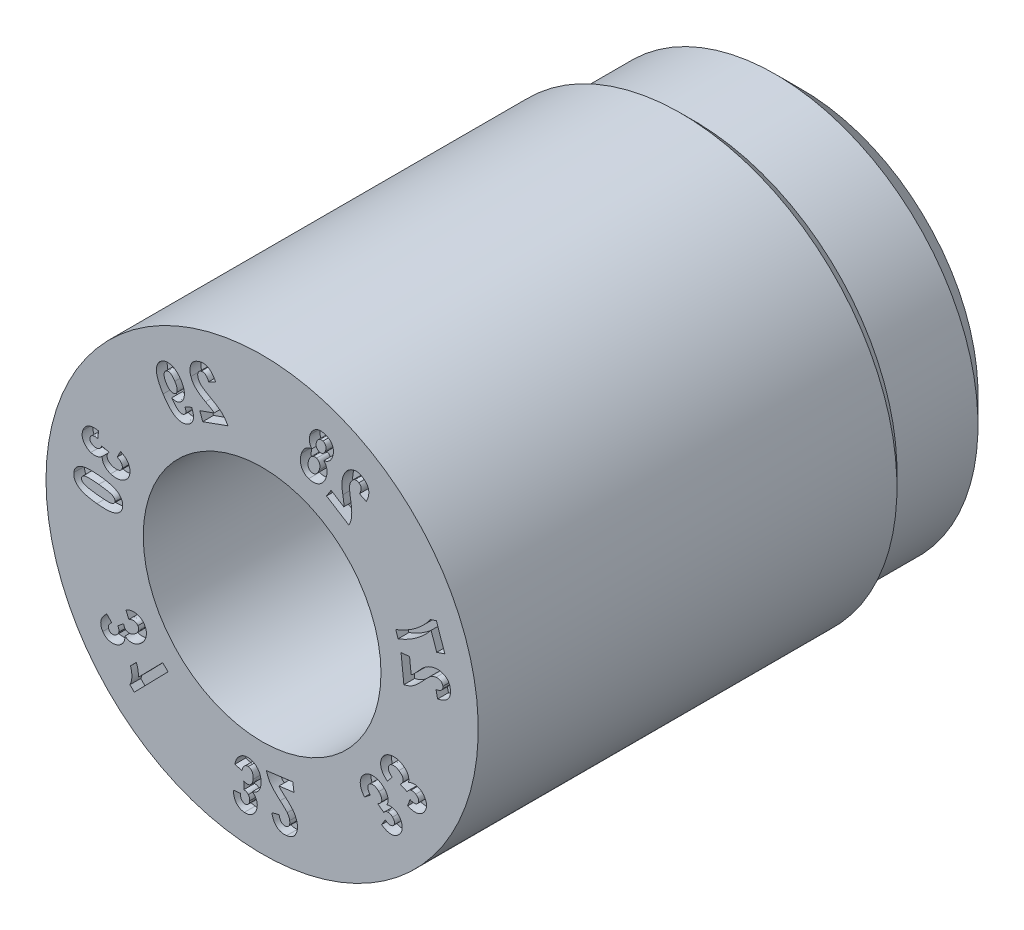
from build123d import *

# Parameters (mm, degrees)
CUT_EXTRUDE2_DEPTH = 0.2


with BuildPart() as part:
    # Sketch2 → Revolve1 (revolve)
    with BuildSketch(Plane(origin=(0, 0, 0), x_dir=(1, 0, 0), z_dir=(0, 1, 0)), mode=Mode.PRIVATE) as revolve1_sk:
        Polygon((3.249621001, 10), (1.15, 10), (1.15, 7.468), (2.2, 7.468), (2.2, 0), (4, 0), (4, 7.75), (3.75, 8), (3.75, 9.499621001), align=None)
    revolve(revolve1_sk.sketch.rotate(Axis((0, 0, -4.849143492), (0, 0, 1)), 180), axis=Axis((0, 0, -4.849143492), (0, 0, 1)))

    # Sketch8 → Cut-Extrude2 (cut)
    # profile 1 of 14: a face of its own
    with BuildSketch(Plane.XY):
        with BuildLine():
            Line((2.72887384, 0.530280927), (2.57118729, 0.513328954))
            Line((2.57118729, 0.513328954), (2.623660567, 0.02527858))
            add(Edge.make_bspline(
                [(2.623660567, 0.02527858), (2.638251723, 0.028520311), (2.667360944, 0.034987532), (2.709413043, 0.050084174), (2.750089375, 0.06853988), (2.782829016, 0.087511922), (2.808985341, 0.105583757), (2.83018659, 0.121491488), (2.852460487, 0.140181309), (2.876207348, 0.161249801), (2.900997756, 0.185162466), (2.927548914, 0.211146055), (2.955026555, 0.240078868), (2.973667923, 0.260298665), (2.983312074, 0.270759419)],
                knots=[0, 0, 0, 0, 1.210903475, 2.415741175, 3.614422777, 4.829304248, 5.477408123, 6.191639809, 6.977581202, 7.834306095, 8.765204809, 9.770030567, 10.846320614, 12, 12, 12, 12], degree=3))
            add(Edge.make_bspline(
                [(2.983312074, 0.270759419), (2.990868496, 0.278966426), (3.005290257, 0.294629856), (3.026166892, 0.316737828), (3.045039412, 0.336493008), (3.062378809, 0.353515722), (3.07737478, 0.368504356), (3.090672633, 0.380929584), (3.10207873, 0.39091499), (3.109355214, 0.396433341), (3.112595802, 0.398890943)],
                knots=[0, 0, 0, 0, 1.469359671, 2.804336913, 4.005076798, 5.067497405, 6.004650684, 6.797449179, 7.46444311, 8, 8, 8, 8], degree=3))
            add(Edge.make_bspline(
                [(3.112595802, 0.398890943), (3.120917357, 0.404670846), (3.137140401, 0.415938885), (3.16336227, 0.428661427), (3.190008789, 0.437728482), (3.208237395, 0.440552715), (3.217240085, 0.441947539)],
                knots=[0, 0, 0, 0, 1.061115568, 2.068666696, 3.046158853, 4, 4, 4, 4], degree=3))
            add(Edge.make_bspline(
                [(3.217240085, 0.441947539), (3.226380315, 0.442708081), (3.243617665, 0.444142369), (3.268130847, 0.441635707), (3.289603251, 0.435842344), (3.307755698, 0.42606176), (3.322572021, 0.413314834), (3.33374337, 0.397766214), (3.341534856, 0.379885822), (3.343547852, 0.366876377), (3.34458258, 0.360189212)],
                knots=[0, 0, 0, 0, 1.284830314, 2.42303217, 3.43989917, 4.386563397, 5.292301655, 6.158766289, 7.053562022, 8, 8, 8, 8], degree=3))
            add(Edge.make_bspline(
                [(3.34458258, 0.360189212), (3.34498587, 0.35285657), (3.345761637, 0.338751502), (3.341333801, 0.318259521), (3.331794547, 0.300184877), (3.317805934, 0.284318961), (3.299042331, 0.270964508), (3.275696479, 0.26029432), (3.248025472, 0.251205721), (3.227759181, 0.24751464), (3.216967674, 0.245549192)],
                knots=[0, 0, 0, 0, 0.913722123, 1.757635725, 2.579276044, 3.438933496, 4.37433614, 5.431505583, 6.632314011, 8, 8, 8, 8], degree=3))
            Line((3.216967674, 0.245549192), (3.24883615, 0.109245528))
            add(Edge.make_bspline(
                [(3.24883615, 0.109245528), (3.259602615, 0.111592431), (3.280512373, 0.116150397), (3.310489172, 0.124877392), (3.337984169, 0.135188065), (3.363183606, 0.146491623), (3.385886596, 0.159250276), (3.406218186, 0.173249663), (3.424103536, 0.188696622), (3.439586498, 0.205443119), (3.452732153, 0.223422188), (3.463883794, 0.242412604), (3.472847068, 0.262529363), (3.47943877, 0.283792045), (3.484341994, 0.306004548), (3.486735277, 0.329367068), (3.486941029, 0.353821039), (3.48557858, 0.370384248), (3.484879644, 0.378881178)],
                knots=[0, 0, 0, 0, 1.316678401, 2.557146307, 3.727226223, 4.823655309, 5.854584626, 6.835260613, 7.768888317, 8.673026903, 9.554907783, 10.425565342, 11.300463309, 12.180346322, 13.081818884, 14.014614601, 14.981496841, 16, 16, 16, 16], degree=3))
            add(Edge.make_bspline(
                [(3.484879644, 0.378881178), (3.483641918, 0.388092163), (3.481241, 0.405959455), (3.475135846, 0.43170585), (3.46661481, 0.455293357), (3.456183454, 0.477082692), (3.443316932, 0.496631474), (3.428482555, 0.514416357), (3.411246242, 0.529911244), (3.392200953, 0.543372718), (3.371958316, 0.554961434), (3.350988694, 0.564582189), (3.32954953, 0.572352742), (3.307687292, 0.578378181), (3.28530415, 0.582279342), (3.262466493, 0.584609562), (3.239134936, 0.584888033), (3.223494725, 0.583524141), (3.215612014, 0.582836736)],
                knots=[0, 0, 0, 0, 1.173652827, 2.276629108, 3.335023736, 4.336619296, 5.321091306, 6.283820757, 7.254537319, 8.239831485, 9.225125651, 10.197062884, 11.150738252, 12.103199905, 13.057936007, 14.017536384, 15.000832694, 16, 16, 16, 16], degree=3))
            add(Edge.make_bspline(
                [(3.215612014, 0.582836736), (3.206625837, 0.581693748), (3.188737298, 0.579418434), (3.162460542, 0.573523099), (3.13674131, 0.566051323), (3.111543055, 0.556889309), (3.086784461, 0.545622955), (3.062251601, 0.532456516), (3.037814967, 0.517245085), (3.01753481, 0.50297596), (3.000998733, 0.490113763), (2.987892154, 0.478778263), (2.973928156, 0.466191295), (2.959238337, 0.452163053), (2.943666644, 0.437001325), (2.927534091, 0.420192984), (2.910489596, 0.402157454), (2.899004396, 0.389509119), (2.89310942, 0.383017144)],
                knots=[0, 0, 0, 0, 1.116805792, 2.223195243, 3.31725657, 4.418851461, 5.527133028, 6.669491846, 7.850789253, 9.075422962, 9.72636706, 10.433968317, 11.212223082, 12.045064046, 12.93920453, 13.892729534, 14.918407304, 16, 16, 16, 16], degree=3))
            add(Edge.make_bspline(
                [(2.89310942, 0.383017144), (2.887649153, 0.377010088), (2.87724621, 0.365565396), (2.862346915, 0.349315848), (2.848698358, 0.334962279), (2.836966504, 0.321857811), (2.826122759, 0.310994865), (2.817159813, 0.301449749), (2.80935657, 0.293897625), (2.797742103, 0.282711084), (2.781544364, 0.268629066), (2.765999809, 0.258562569), (2.758532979, 0.253727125)],
                knots=[0, 0, 0, 0, 1.30077431, 2.478245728, 3.532467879, 4.474445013, 5.295791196, 5.991390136, 6.572169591, 7.035389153, 8.575948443, 10, 10, 10, 10], degree=3))
            Line((2.758532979, 0.253727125), (2.72887384, 0.530280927))
        make_face()
    # profile 2 of 14: a face of its own
    with BuildSketch(Plane.XY):
        with BuildLine():
            Line((3.23081821, 0.848166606), (3.381035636, 0.899400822))
            Line((3.381035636, 0.899400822), (3.226427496, 1.353003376))
            Line((3.226427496, 1.353003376), (3.109080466, 1.312963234))
            add(Edge.make_bspline(
                [(3.109080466, 1.312963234), (3.104794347, 1.306233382), (3.095975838, 1.292386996), (3.081175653, 1.271685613), (3.064715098, 1.250332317), (3.046250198, 1.228516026), (3.026427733, 1.205775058), (3.004462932, 1.182695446), (2.981107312, 1.158606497), (2.947195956, 1.125921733), (2.902437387, 1.085307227), (2.845133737, 1.039150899), (2.784394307, 0.995602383), (2.731462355, 0.961749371), (2.688320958, 0.936049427), (2.65628006, 0.917935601), (2.62468719, 0.901120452), (2.593562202, 0.885572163), (2.562927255, 0.871228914), (2.532698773, 0.858340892), (2.50317444, 0.84626427), (2.483370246, 0.839411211), (2.473617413, 0.836036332)],
                knots=[0, 0, 0, 0, 0.59319857, 1.220480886, 1.891472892, 2.597434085, 3.345402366, 4.134310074, 4.966143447, 5.840124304, 7.636039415, 9.45836528, 11.308165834, 13.190672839, 14.128457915, 15.041954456, 15.92725675, 16.789349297, 17.628831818, 18.442016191, 19.232750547, 20, 20, 20, 20], degree=3))
            Line((2.473617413, 0.836036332), (2.517223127, 0.708440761))
            add(Edge.make_bspline(
                [(2.517223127, 0.708440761), (2.532006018, 0.714055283), (2.561600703, 0.725295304), (2.605213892, 0.744294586), (2.648479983, 0.764431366), (2.690974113, 0.786643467), (2.733036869, 0.810079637), (2.774517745, 0.835201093), (2.815369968, 0.861925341), (2.855535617, 0.890129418), (2.894613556, 0.919641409), (2.932517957, 0.949890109), (2.968858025, 0.981090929), (3.003598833, 1.013160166), (3.037058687, 1.045946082), (3.068916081, 1.07961201), (3.099302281, 1.114131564), (3.118356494, 1.137942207), (3.127864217, 1.149823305)],
                knots=[0, 0, 0, 0, 0.995131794, 1.992209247, 2.993331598, 3.998154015, 5.009292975, 6.023543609, 7.049650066, 8.081247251, 9.111904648, 10.131308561, 11.132997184, 12.125745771, 13.106564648, 14.080818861, 15.042361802, 16, 16, 16, 16], degree=3))
            Line((3.127864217, 1.149823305), (3.23081821, 0.848166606))
        make_face()
    # profile 3 of 14: a face of its own
    with BuildSketch(Plane.XY):
        with BuildLine():
            Line((1.276591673, 2.468546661), (1.192384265, 2.3346842))
            Line((1.192384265, 2.3346842), (1.607103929, 2.073959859))
            add(Edge.make_bspline(
                [(1.607103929, 2.073959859), (1.613544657, 2.087381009), (1.62641751, 2.114205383), (1.640797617, 2.156374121), (1.651263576, 2.19970255), (1.656801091, 2.23699331), (1.658800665, 2.268688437), (1.659160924, 2.295146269), (1.658633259, 2.32420232), (1.6567436, 2.35582735), (1.653653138, 2.390051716), (1.649238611, 2.426885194), (1.643833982, 2.466330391), (1.639590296, 2.493456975), (1.637400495, 2.50745467)],
                knots=[0, 0, 0, 0, 1.208822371, 2.41603029, 3.61173594, 4.82739827, 5.473599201, 6.191163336, 6.976981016, 7.83455647, 8.764940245, 9.768954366, 10.848749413, 12, 12, 12, 12], degree=3))
            add(Edge.make_bspline(
                [(1.637400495, 2.50745467), (1.635678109, 2.518461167), (1.632395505, 2.539437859), (1.62802686, 2.569453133), (1.624041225, 2.596446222), (1.621316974, 2.620533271), (1.619170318, 2.641622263), (1.617581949, 2.659700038), (1.616756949, 2.674832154), (1.616994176, 2.683913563), (1.617099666, 2.68795186)],
                knots=[0, 0, 0, 0, 1.470404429, 2.802365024, 4.003523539, 5.071488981, 6.001522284, 6.801330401, 7.466978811, 8, 8, 8, 8], degree=3))
            add(Edge.make_bspline(
                [(1.617099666, 2.68795186), (1.617731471, 2.698043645), (1.618964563, 2.717739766), (1.625226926, 2.746130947), (1.634390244, 2.772711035), (1.643576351, 2.788664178), (1.648122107, 2.79655861)],
                knots=[0, 0, 0, 0, 1.060684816, 2.070137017, 3.045005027, 4, 4, 4, 4], degree=3))
            add(Edge.make_bspline(
                [(1.648122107, 2.79655861), (1.65319842, 2.804171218), (1.662774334, 2.818531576), (1.679785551, 2.836252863), (1.697385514, 2.849725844), (1.716243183, 2.857736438), (1.735315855, 2.861255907), (1.754365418, 2.860600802), (1.773229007, 2.855589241), (1.784685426, 2.849146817), (1.79058099, 2.845831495)],
                knots=[0, 0, 0, 0, 1.286212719, 2.426300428, 3.443909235, 4.385890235, 5.28260689, 6.154823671, 7.050457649, 8, 8, 8, 8], degree=3))
            add(Edge.make_bspline(
                [(1.79058099, 2.845831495), (1.796590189, 2.841598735), (1.80813509, 2.833466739), (1.821327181, 2.817240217), (1.829837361, 2.798733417), (1.833565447, 2.777902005), (1.832267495, 2.754958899), (1.826442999, 2.730003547), (1.816132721, 2.702891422), (1.806627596, 2.684738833), (1.801569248, 2.675078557)],
                knots=[0, 0, 0, 0, 0.916356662, 1.760508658, 2.58176228, 3.440675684, 4.380995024, 5.437493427, 6.636309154, 8, 8, 8, 8], degree=3))
            Line((1.801569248, 2.675078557), (1.928108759, 2.615611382))
            add(Edge.make_bspline(
                [(1.928108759, 2.615611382), (1.932929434, 2.625502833), (1.942287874, 2.644705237), (1.953773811, 2.673592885), (1.963088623, 2.701347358), (1.969657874, 2.728113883), (1.973545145, 2.753824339), (1.975434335, 2.778431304), (1.974241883, 2.80201835), (1.970705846, 2.824584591), (1.964716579, 2.845992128), (1.95678847, 2.866502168), (1.946264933, 2.885812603), (1.934047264, 2.904424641), (1.91924611, 2.921759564), (1.902479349, 2.938161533), (1.88357785, 2.953636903), (1.869732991, 2.962763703), (1.86265978, 2.967426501)],
                knots=[0, 0, 0, 0, 1.316512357, 2.555762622, 3.717505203, 4.818052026, 5.849248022, 6.826902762, 7.766324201, 8.668970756, 9.555046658, 10.422053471, 11.294580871, 12.182061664, 13.082001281, 14.016408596, 14.986601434, 16, 16, 16, 16], degree=3))
            add(Edge.make_bspline(
                [(1.86265978, 2.967426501), (1.854712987, 2.972209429), (1.83929078, 2.981491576), (1.815187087, 2.992226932), (1.791516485, 3.000378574), (1.767999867, 3.005477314), (1.744753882, 3.007632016), (1.721696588, 3.006821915), (1.698904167, 3.003075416), (1.676627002, 2.996441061), (1.655205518, 2.987535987), (1.634572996, 2.977325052), (1.615259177, 2.965267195), (1.596893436, 2.951992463), (1.580175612, 2.936594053), (1.564163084, 2.920217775), (1.549503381, 2.902049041), (1.540921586, 2.888944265), (1.536575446, 2.88230752)],
                knots=[0, 0, 0, 0, 1.173365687, 2.277131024, 3.333562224, 4.338328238, 5.316104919, 6.281955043, 7.251497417, 8.232655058, 9.217801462, 10.185934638, 11.143842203, 12.097616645, 13.050385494, 14.017437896, 14.995957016, 16, 16, 16, 16], degree=3))
            add(Edge.make_bspline(
                [(1.536575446, 2.88230752), (1.531941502, 2.874569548), (1.52272158, 2.859173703), (1.510837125, 2.83506583), (1.500650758, 2.810327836), (1.492452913, 2.784794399), (1.486046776, 2.75844261), (1.48106032, 2.731064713), (1.477939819, 2.702502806), (1.47652586, 2.677754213), (1.476633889, 2.656845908), (1.477067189, 2.639594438), (1.478287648, 2.620908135), (1.480274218, 2.60080827), (1.482553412, 2.579238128), (1.485729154, 2.556245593), (1.489257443, 2.531722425), (1.492125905, 2.514919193), (1.493603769, 2.506261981)],
                knots=[0, 0, 0, 0, 1.114583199, 2.217628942, 3.318941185, 4.419045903, 5.529098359, 6.669323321, 7.85651922, 9.078812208, 9.731191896, 10.440705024, 11.21182148, 12.045370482, 12.937425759, 13.892879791, 14.914388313, 16, 16, 16, 16], degree=3))
            add(Edge.make_bspline(
                [(1.493603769, 2.506261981), (1.494931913, 2.49827585), (1.497456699, 2.483094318), (1.500843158, 2.46135842), (1.503906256, 2.441888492), (1.506421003, 2.424532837), (1.508470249, 2.409382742), (1.51044169, 2.396412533), (1.511632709, 2.385582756), (1.513070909, 2.369495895), (1.513897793, 2.348098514), (1.512380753, 2.329686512), (1.511654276, 2.320869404)],
                knots=[0, 0, 0, 0, 1.299886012, 2.471066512, 3.532081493, 4.464485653, 5.286776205, 5.986809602, 6.570702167, 7.03567512, 8.58044916, 10, 10, 10, 10], degree=3))
            Line((1.511654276, 2.320869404), (1.276591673, 2.468546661))
        make_face()
    # profile 4 of 14: a face of its own
    with BuildSketch(Plane.XY):
        with BuildLine():
            add(Edge.make_bspline(
                [(1.142676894, 2.877640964), (1.15203531, 2.879317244), (1.170317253, 2.882591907), (1.196273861, 2.891717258), (1.219860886, 2.904434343), (1.241442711, 2.920271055), (1.260594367, 2.939740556), (1.277200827, 2.962611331), (1.291764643, 2.988581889), (1.298994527, 3.007610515), (1.302726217, 3.017432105)],
                knots=[0, 0, 0, 0, 1.014369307, 1.981600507, 2.923907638, 3.86750838, 4.830476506, 5.828199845, 6.879029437, 8, 8, 8, 8], degree=3))
            add(Edge.make_bspline(
                [(1.302726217, 3.017432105), (1.305396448, 3.02563029), (1.310594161, 3.041588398), (1.316205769, 3.06560632), (1.319624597, 3.088987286), (1.320431, 3.111766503), (1.319566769, 3.133899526), (1.316013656, 3.155344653), (1.310529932, 3.176173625), (1.302679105, 3.1962041), (1.292905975, 3.2151944), (1.281188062, 3.232950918), (1.267415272, 3.249109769), (1.251877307, 3.263957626), (1.234549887, 3.277593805), (1.215096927, 3.289370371), (1.193918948, 3.29999676), (1.178901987, 3.305756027), (1.171198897, 3.308710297)],
                knots=[0, 0, 0, 0, 1.145905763, 2.230553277, 3.275126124, 4.282008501, 5.257086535, 6.214897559, 7.165828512, 8.11588331, 9.069135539, 10.000669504, 10.937791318, 11.885618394, 12.854203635, 13.862834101, 14.903720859, 16, 16, 16, 16], degree=3))
            add(Edge.make_bspline(
                [(1.171198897, 3.308710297), (1.16291999, 3.311384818), (1.146824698, 3.316584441), (1.122608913, 3.321967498), (1.099203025, 3.324615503), (1.076531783, 3.324889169), (1.054715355, 3.322562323), (1.033605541, 3.317845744), (1.013551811, 3.31011197), (0.994281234, 3.300420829), (0.976277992, 3.288574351), (0.959479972, 3.275253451), (0.943802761, 3.260666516), (0.929830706, 3.244268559), (0.916936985, 3.226713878), (0.905591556, 3.207619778), (0.895478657, 3.187173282), (0.890079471, 3.172720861), (0.887339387, 3.165386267)],
                knots=[0, 0, 0, 0, 1.163810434, 2.262601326, 3.312928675, 4.310593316, 5.290339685, 6.242747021, 7.196039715, 8.158748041, 9.124249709, 10.07403018, 11.025312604, 11.984475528, 12.952360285, 13.936666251, 14.952859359, 16, 16, 16, 16], degree=3))
            add(Edge.make_bspline(
                [(0.887339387, 3.165386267), (0.884146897, 3.155291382), (0.877952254, 3.135703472), (0.872992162, 3.10594441), (0.871758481, 3.077109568), (0.874775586, 3.049368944), (0.881214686, 3.02311441), (0.891193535, 2.998701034), (0.903991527, 2.975805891), (0.915259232, 2.962479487), (0.920928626, 2.955774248)],
                knots=[0, 0, 0, 0, 1.136897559, 2.206012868, 3.232304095, 4.229794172, 5.195265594, 6.127978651, 7.058084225, 8, 8, 8, 8], degree=3))
            add(Edge.make_bspline(
                [(0.920928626, 2.955774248), (0.909717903, 2.954128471), (0.887829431, 2.95091516), (0.856904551, 2.940261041), (0.828511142, 2.925840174), (0.803070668, 2.906631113), (0.780285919, 2.883254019), (0.76021869, 2.855635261), (0.742971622, 2.823676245), (0.733951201, 2.800416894), (0.729271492, 2.788350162)],
                knots=[0, 0, 0, 0, 1.005256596, 1.962721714, 2.892328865, 3.825456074, 4.782263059, 5.784052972, 6.850387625, 8, 8, 8, 8], degree=3))
            add(Edge.make_bspline(
                [(0.729271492, 2.788350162), (0.725070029, 2.775559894), (0.716896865, 2.750678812), (0.709968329, 2.712754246), (0.706914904, 2.675898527), (0.708935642, 2.640245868), (0.714572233, 2.606367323), (0.724872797, 2.574905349), (0.738863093, 2.545816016), (0.75704449, 2.519613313), (0.778581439, 2.496329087), (0.803361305, 2.476414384), (0.831038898, 2.459683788), (0.85128421, 2.45173873), (0.861552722, 2.447708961)],
                knots=[0, 0, 0, 0, 1.180886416, 2.297194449, 3.376389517, 4.420753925, 5.424752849, 6.383638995, 7.317725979, 8.249356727, 9.173352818, 10.093135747, 11.032829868, 12, 12, 12, 12], degree=3))
            add(Edge.make_bspline(
                [(0.861552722, 2.447708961), (0.869778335, 2.445040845), (0.885949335, 2.439795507), (0.910641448, 2.434881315), (0.935030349, 2.432381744), (0.959083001, 2.432499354), (0.982841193, 2.435095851), (1.006185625, 2.440504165), (1.02928522, 2.448255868), (1.051866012, 2.458431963), (1.07350908, 2.471144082), (1.093804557, 2.486199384), (1.112605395, 2.503454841), (1.129932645, 2.522829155), (1.145507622, 2.544605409), (1.159644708, 2.568510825), (1.172390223, 2.594644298), (1.17941521, 2.613150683), (1.183018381, 2.622642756)],
                knots=[0, 0, 0, 0, 1.008746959, 1.983128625, 2.932350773, 3.866363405, 4.785667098, 5.716369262, 6.657964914, 7.62593945, 8.602245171, 9.582312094, 10.570208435, 11.576332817, 12.610892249, 13.690190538, 14.81528031, 16, 16, 16, 16], degree=3))
            add(Edge.make_bspline(
                [(1.183018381, 2.622642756), (1.187013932, 2.634983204), (1.194765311, 2.658923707), (1.201006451, 2.69519198), (1.20296074, 2.73011095), (1.19988947, 2.763604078), (1.192458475, 2.795448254), (1.180471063, 2.825325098), (1.16398186, 2.853137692), (1.149830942, 2.869412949), (1.142676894, 2.877640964)],
                knots=[0, 0, 0, 0, 1.141559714, 2.214628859, 3.232000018, 4.214715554, 5.167402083, 6.102925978, 7.040927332, 8, 8, 8, 8], degree=3))
        make_face()
        with BuildLine():
            add(Edge.make_bspline(
                [(1.173276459, 3.050028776), (1.170318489, 3.042287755), (1.164734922, 3.027675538), (1.152818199, 3.00860991), (1.139308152, 2.993142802), (1.123657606, 2.982028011), (1.107016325, 2.974662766), (1.089685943, 2.971461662), (1.071919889, 2.971788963), (1.060533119, 2.97510382), (1.054693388, 2.976803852)],
                knots=[0, 0, 0, 0, 1.266609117, 2.390894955, 3.425131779, 4.391582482, 5.307208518, 6.190360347, 7.071922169, 8, 8, 8, 8], degree=3))
            add(Edge.make_bspline(
                [(1.054693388, 2.976803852), (1.048975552, 2.979125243), (1.037823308, 2.983652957), (1.023561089, 2.994665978), (1.012036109, 3.008219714), (1.003438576, 3.024401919), (0.998200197, 3.042939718), (0.997309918, 3.063495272), (1.000240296, 3.085761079), (1.004938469, 3.100666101), (1.00742322, 3.108549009)],
                knots=[0, 0, 0, 0, 0.936477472, 1.826534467, 2.713325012, 3.629782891, 4.596795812, 5.622770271, 6.742740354, 8, 8, 8, 8], degree=3))
            add(Edge.make_bspline(
                [(1.00742322, 3.108549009), (1.010352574, 3.116012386), (1.015924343, 3.130208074), (1.027425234, 3.148864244), (1.040805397, 3.164040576), (1.056294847, 3.175083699), (1.0728919, 3.182305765), (1.090000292, 3.185901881), (1.107595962, 3.185668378), (1.118838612, 3.182312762), (1.124590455, 3.180595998)],
                knots=[0, 0, 0, 0, 1.244417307, 2.36693951, 3.388604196, 4.369504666, 5.29882057, 6.183174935, 7.070495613, 8, 8, 8, 8], degree=3))
            add(Edge.make_bspline(
                [(1.124590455, 3.180595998), (1.130385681, 3.178177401), (1.141643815, 3.173478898), (1.156341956, 3.162618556), (1.167793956, 3.148688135), (1.17640291, 3.132363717), (1.181583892, 3.113916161), (1.182750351, 3.093728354), (1.180264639, 3.072045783), (1.175679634, 3.057600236), (1.173276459, 3.050028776)],
                knots=[0, 0, 0, 0, 0.960169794, 1.865280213, 2.76836551, 3.702597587, 4.675586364, 5.681241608, 6.784650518, 8, 8, 8, 8], degree=3))
        make_face(mode=Mode.SUBTRACT)
        with BuildLine():
            add(Edge.make_bspline(
                [(1.057655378, 2.684440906), (1.055650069, 2.678970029), (1.051739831, 2.668302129), (1.044872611, 2.653204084), (1.037414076, 2.639438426), (1.029734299, 2.626738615), (1.021053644, 2.615640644), (1.012145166, 2.605477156), (1.002331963, 2.596943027), (0.989154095, 2.587279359), (0.972092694, 2.578336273), (0.951055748, 2.572358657), (0.929914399, 2.571614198), (0.916642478, 2.575305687), (0.909944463, 2.577168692)],
                knots=[0, 0, 0, 0, 1.031139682, 2.010663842, 2.93231511, 3.801989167, 4.633416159, 5.423097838, 6.190390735, 6.929646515, 8.313467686, 9.573244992, 10.775276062, 12, 12, 12, 12], degree=3))
            add(Edge.make_bspline(
                [(0.909944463, 2.577168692), (0.903532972, 2.579869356), (0.890930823, 2.585177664), (0.875173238, 2.598708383), (0.862776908, 2.615782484), (0.855342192, 2.632649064), (0.851188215, 2.647726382), (0.849359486, 2.660212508), (0.849039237, 2.673472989), (0.849292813, 2.687513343), (0.851405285, 2.70232291), (0.854439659, 2.717947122), (0.858944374, 2.734323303), (0.862599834, 2.745399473), (0.864481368, 2.751100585)],
                knots=[0, 0, 0, 0, 1.238575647, 2.434490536, 3.659926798, 4.989591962, 5.707140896, 6.454241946, 7.240616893, 8.078709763, 8.963675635, 9.912918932, 10.925740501, 12, 12, 12, 12], degree=3))
            add(Edge.make_bspline(
                [(0.864481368, 2.751100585), (0.868128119, 2.760593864), (0.875092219, 2.778722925), (0.889487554, 2.802713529), (0.906292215, 2.822345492), (0.925293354, 2.837225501), (0.945419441, 2.847659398), (0.966124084, 2.853187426), (0.987124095, 2.853385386), (1.000406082, 2.849693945), (1.007150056, 2.847819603)],
                knots=[0, 0, 0, 0, 1.267741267, 2.420971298, 3.473833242, 4.476546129, 5.415160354, 6.285484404, 7.129448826, 8, 8, 8, 8], degree=3))
            add(Edge.make_bspline(
                [(1.007150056, 2.847819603), (1.013564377, 2.845120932), (1.02617209, 2.83981654), (1.041978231, 2.82617976), (1.054656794, 2.808990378), (1.063738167, 2.788167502), (1.069207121, 2.764667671), (1.070066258, 2.739097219), (1.066426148, 2.711887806), (1.060665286, 2.693859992), (1.057655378, 2.684440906)],
                knots=[0, 0, 0, 0, 0.872630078, 1.715203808, 2.593262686, 3.547039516, 4.558156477, 5.617676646, 6.755295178, 8, 8, 8, 8], degree=3))
        make_face(mode=Mode.SUBTRACT)
    # profile 5 of 14: a face of its own
    with BuildSketch(Plane.XY):
        with BuildLine():
            Line((-1.153116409, 2.530311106), (-1.099541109, 2.380093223))
            Line((-1.099541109, 2.380093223), (-0.63463606, 2.545921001))
            add(Edge.make_bspline(
                [(-0.63463606, 2.545921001), (-0.641225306, 2.55943034), (-0.65435385, 2.586346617), (-0.678850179, 2.623978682), (-0.706512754, 2.659353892), (-0.732569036, 2.687107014), (-0.756279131, 2.708594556), (-0.777064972, 2.725260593), (-0.800477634, 2.742761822), (-0.826633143, 2.761085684), (-0.855680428, 2.780042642), (-0.887556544, 2.79960568), (-0.92212944, 2.820006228), (-0.946304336, 2.833428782), (-0.958805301, 2.840369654)],
                knots=[0, 0, 0, 0, 1.210812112, 2.412446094, 3.611470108, 4.827949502, 5.475904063, 6.189792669, 6.974926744, 7.832254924, 8.763959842, 9.770840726, 10.847290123, 12, 12, 12, 12], degree=3))
            add(Edge.make_bspline(
                [(-0.958805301, 2.840369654), (-0.968566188, 2.84584207), (-0.987220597, 2.856300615), (-1.013805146, 2.871388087), (-1.037510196, 2.885307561), (-1.058359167, 2.898005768), (-1.076506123, 2.909247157), (-1.091725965, 2.919379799), (-1.104216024, 2.928109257), (-1.11125292, 2.933906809), (-1.114388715, 2.936490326)],
                knots=[0, 0, 0, 0, 1.466976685, 2.803596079, 4.007152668, 5.070478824, 6.003858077, 6.805146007, 7.46754678, 8, 8, 8, 8], degree=3))
            add(Edge.make_bspline(
                [(-1.114388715, 2.936490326), (-1.122002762, 2.943299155), (-1.136851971, 2.956577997), (-1.155425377, 2.979283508), (-1.170651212, 3.003209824), (-1.177572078, 3.02044326), (-1.181002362, 3.028984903)],
                knots=[0, 0, 0, 0, 1.061716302, 2.070600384, 3.043705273, 4, 4, 4, 4], degree=3))
            add(Edge.make_bspline(
                [(-1.181002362, 3.028984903), (-1.183842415, 3.037775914), (-1.189177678, 3.054290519), (-1.192666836, 3.078837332), (-1.191970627, 3.10117609), (-1.186719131, 3.121203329), (-1.17765285, 3.138565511), (-1.165336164, 3.15322221), (-1.149545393, 3.164879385), (-1.137353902, 3.169934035), (-1.131024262, 3.172558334)],
                knots=[0, 0, 0, 0, 1.28889712, 2.421294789, 3.446017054, 4.391561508, 5.288374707, 6.161078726, 7.045259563, 8, 8, 8, 8], degree=3))
            add(Edge.make_bspline(
                [(-1.131024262, 3.172558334), (-1.123935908, 3.174705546), (-1.110299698, 3.178836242), (-1.089193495, 3.179225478), (-1.069225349, 3.174268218), (-1.05062608, 3.163973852), (-1.033034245, 3.148956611), (-1.016926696, 3.128703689), (-1.002027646, 3.103503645), (-0.993589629, 3.084641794), (-0.989103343, 3.074613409)],
                knots=[0, 0, 0, 0, 0.915818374, 1.761804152, 2.583658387, 3.441146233, 4.376057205, 5.436996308, 6.637313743, 8, 8, 8, 8], degree=3))
            Line((-0.989103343, 3.074613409), (-0.863066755, 3.137827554))
            add(Edge.make_bspline(
                [(-0.863066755, 3.137827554), (-0.867877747, 3.147849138), (-0.877204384, 3.167277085), (-0.892856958, 3.194464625), (-0.909301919, 3.218978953), (-0.926386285, 3.240884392), (-0.944149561, 3.260165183), (-0.962587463, 3.276842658), (-0.981817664, 3.290850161), (-1.001990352, 3.301874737), (-1.022646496, 3.310612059), (-1.043939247, 3.316852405), (-1.065727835, 3.320874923), (-1.088051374, 3.322611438), (-1.110939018, 3.322001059), (-1.134318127, 3.318623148), (-1.158367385, 3.313472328), (-1.174243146, 3.308186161), (-1.182373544, 3.305478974)],
                knots=[0, 0, 0, 0, 1.319771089, 2.558521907, 3.721606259, 4.82275391, 5.854211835, 6.830927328, 7.770817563, 8.672209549, 9.55489539, 10.429349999, 11.30169805, 12.181513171, 13.083783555, 14.01438395, 14.983113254, 16, 16, 16, 16], degree=3))
            add(Edge.make_bspline(
                [(-1.182373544, 3.305478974), (-1.19110363, 3.302166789), (-1.208064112, 3.295732), (-1.231583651, 3.283437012), (-1.252844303, 3.269801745), (-1.271564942, 3.254362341), (-1.287708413, 3.2371381), (-1.301476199, 3.218483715), (-1.312791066, 3.198154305), (-1.321367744, 3.176408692), (-1.327765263, 3.153905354), (-1.332494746, 3.13116733), (-1.334962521, 3.108314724), (-1.33582973, 3.085466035), (-1.334531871, 3.062641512), (-1.331042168, 3.039799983), (-1.325955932, 3.01684882), (-1.320929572, 3.001825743), (-1.31839906, 2.994262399)],
                knots=[0, 0, 0, 0, 1.172052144, 2.277018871, 3.32677887, 4.340170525, 5.316659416, 6.285120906, 7.245666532, 8.230669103, 9.214509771, 10.181848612, 11.144446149, 12.098449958, 13.051434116, 14.011175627, 14.998729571, 16, 16, 16, 16], degree=3))
            add(Edge.make_bspline(
                [(-1.31839906, 2.994262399), (-1.315172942, 2.985750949), (-1.308758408, 2.968827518), (-1.297236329, 2.94430017), (-1.283697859, 2.92101438), (-1.268708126, 2.898599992), (-1.252019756, 2.876932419), (-1.233263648, 2.85611405), (-1.21271418, 2.83573777), (-1.1939129, 2.819405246), (-1.177355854, 2.80632404), (-1.163352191, 2.795971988), (-1.14773954, 2.785273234), (-1.130762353, 2.774071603), (-1.112145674, 2.762578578), (-1.092128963, 2.750475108), (-1.070377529, 2.738257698), (-1.055402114, 2.729925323), (-1.047704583, 2.72564239)],
                knots=[0, 0, 0, 0, 1.116679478, 2.220308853, 3.320570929, 4.4187232, 5.527162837, 6.673310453, 7.854533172, 9.07624537, 9.726844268, 10.443494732, 11.21262712, 12.049020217, 12.939050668, 13.897081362, 14.919076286, 16, 16, 16, 16], degree=3))
            add(Edge.make_bspline(
                [(-1.047704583, 2.72564239), (-1.04058741, 2.721649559), (-1.027016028, 2.714035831), (-1.007481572, 2.703458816), (-0.990196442, 2.693552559), (-0.974839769, 2.684822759), (-0.961501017, 2.677063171), (-0.950179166, 2.670280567), (-0.940802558, 2.664590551), (-0.927130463, 2.655844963), (-0.909868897, 2.642944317), (-0.896232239, 2.630317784), (-0.889701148, 2.624270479)],
                knots=[0, 0, 0, 0, 1.300063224, 2.479025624, 3.538716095, 4.473772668, 5.293181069, 5.997018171, 6.576348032, 7.040371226, 8.58252631, 10, 10, 10, 10], degree=3))
            Line((-0.889701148, 2.624270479), (-1.153116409, 2.530311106))
        make_face()
    # profile 6 of 14: a face of its own
    with BuildSketch(Plane.XY):
        with BuildLine():
            Line((-1.30464309, 2.508096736), (-1.42876848, 2.451199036))
            add(Edge.make_bspline(
                [(-1.42876848, 2.451199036), (-1.425406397, 2.444089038), (-1.419090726, 2.430732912), (-1.41288073, 2.410738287), (-1.409316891, 2.392475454), (-1.409552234, 2.375609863), (-1.412809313, 2.360271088), (-1.419544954, 2.34649674), (-1.429792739, 2.334599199), (-1.438450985, 2.328476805), (-1.442925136, 2.325313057)],
                knots=[0, 0, 0, 0, 1.336460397, 2.51053978, 3.553551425, 4.48852744, 5.360632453, 6.200567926, 7.070143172, 8, 8, 8, 8], degree=3))
            add(Edge.make_bspline(
                [(-1.442925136, 2.325313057), (-1.446264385, 2.323432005), (-1.452833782, 2.319731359), (-1.463429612, 2.315825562), (-1.474393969, 2.313702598), (-1.485688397, 2.312631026), (-1.497350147, 2.313967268), (-1.509358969, 2.316423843), (-1.52173574, 2.320599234), (-1.534707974, 2.326296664), (-1.548450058, 2.334560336), (-1.562973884, 2.345873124), (-1.57867704, 2.360097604), (-1.595639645, 2.377185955), (-1.6134011, 2.397641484), (-1.632495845, 2.420968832), (-1.652838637, 2.447256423), (-1.666370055, 2.466087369), (-1.673444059, 2.475931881)],
                knots=[0, 0, 0, 0, 0.609536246, 1.199157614, 1.787609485, 2.384353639, 2.996821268, 3.647677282, 4.333576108, 5.071781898, 5.899551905, 6.878841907, 7.997857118, 9.271104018, 10.709480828, 12.308635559, 14.070215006, 16, 16, 16, 16], degree=3))
            add(Edge.make_bspline(
                [(-1.673444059, 2.475931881), (-1.666633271, 2.473250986), (-1.653369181, 2.468029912), (-1.633154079, 2.462830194), (-1.613398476, 2.460084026), (-1.594117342, 2.459621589), (-1.575335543, 2.461860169), (-1.556945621, 2.466192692), (-1.539117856, 2.473402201), (-1.527882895, 2.479841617), (-1.522195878, 2.48310118)],
                knots=[0, 0, 0, 0, 1.112045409, 2.165721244, 3.164374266, 4.139256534, 5.089068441, 6.032508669, 7.004076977, 8, 8, 8, 8], degree=3))
            add(Edge.make_bspline(
                [(-1.522195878, 2.48310118), (-1.51650174, 2.486963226), (-1.505230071, 2.49460823), (-1.490428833, 2.508643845), (-1.477282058, 2.524248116), (-1.465968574, 2.541706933), (-1.456660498, 2.561035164), (-1.449129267, 2.582037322), (-1.443354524, 2.604807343), (-1.439481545, 2.629122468), (-1.437970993, 2.654530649), (-1.438925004, 2.680467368), (-1.442158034, 2.706816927), (-1.448526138, 2.733312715), (-1.457027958, 2.760243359), (-1.468402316, 2.787328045), (-1.482197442, 2.814806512), (-1.492988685, 2.832729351), (-1.498511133, 2.841901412)],
                knots=[0, 0, 0, 0, 0.827444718, 1.637944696, 2.446854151, 3.280501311, 4.136055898, 5.024849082, 5.963295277, 6.961219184, 7.985783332, 9.023474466, 10.083343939, 11.177139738, 12.300453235, 13.481190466, 14.710992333, 16, 16, 16, 16], degree=3))
            add(Edge.make_bspline(
                [(-1.498511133, 2.841901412), (-1.504780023, 2.851511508), (-1.51697856, 2.870211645), (-1.537005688, 2.895995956), (-1.557858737, 2.918983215), (-1.579270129, 2.939575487), (-1.601660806, 2.957270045), (-1.624848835, 2.972172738), (-1.648777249, 2.984412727), (-1.673339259, 2.993898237), (-1.698042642, 3.000766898), (-1.722511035, 3.004651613), (-1.746440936, 3.006475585), (-1.769868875, 3.004924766), (-1.792826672, 3.001389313), (-1.815138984, 2.99447335), (-1.837109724, 2.985370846), (-1.850910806, 2.977225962), (-1.857910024, 2.973095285)],
                knots=[0, 0, 0, 0, 1.285707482, 2.501838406, 3.654677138, 4.762151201, 5.827804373, 6.848054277, 7.847085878, 8.835049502, 9.794678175, 10.715072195, 11.608480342, 12.478207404, 13.341128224, 14.205814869, 15.090079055, 16, 16, 16, 16], degree=3))
            add(Edge.make_bspline(
                [(-1.857910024, 2.973095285), (-1.865349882, 2.968017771), (-1.880026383, 2.958001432), (-1.899480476, 2.940035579), (-1.915956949, 2.919715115), (-1.92979804, 2.897469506), (-1.940775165, 2.873042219), (-1.948814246, 2.846563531), (-1.954386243, 2.817993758), (-1.956880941, 2.787241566), (-1.9561963, 2.754154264), (-1.950811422, 2.718771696), (-1.9416996, 2.680939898), (-1.92825995, 2.640752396), (-1.91040913, 2.598260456), (-1.888473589, 2.553338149), (-1.862785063, 2.50574148), (-1.843087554, 2.473941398), (-1.832877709, 2.457458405)],
                knots=[0, 0, 0, 0, 0.749511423, 1.478550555, 2.196049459, 2.922514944, 3.654719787, 4.419833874, 5.222472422, 6.074579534, 6.984983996, 7.972343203, 9.049067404, 10.222878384, 11.497481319, 12.885067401, 14.385431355, 16, 16, 16, 16], degree=3))
            add(Edge.make_bspline(
                [(-1.832877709, 2.457458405), (-1.822154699, 2.440844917), (-1.801495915, 2.408837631), (-1.76925839, 2.364173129), (-1.737309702, 2.324434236), (-1.705783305, 2.289403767), (-1.674472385, 2.259314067), (-1.643422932, 2.234166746), (-1.612798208, 2.213664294), (-1.582233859, 2.198303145), (-1.552174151, 2.187303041), (-1.522867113, 2.17958285), (-1.494055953, 2.175663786), (-1.465850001, 2.175586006), (-1.438259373, 2.178890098), (-1.411288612, 2.18592834), (-1.384868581, 2.196393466), (-1.36834686, 2.206065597), (-1.359960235, 2.210975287)],
                knots=[0, 0, 0, 0, 1.58923546, 3.061796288, 4.425331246, 5.686093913, 6.84754572, 7.912093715, 8.894125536, 9.804064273, 10.65442208, 11.462984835, 12.23578764, 12.984755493, 13.724427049, 14.462958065, 15.219778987, 16, 16, 16, 16], degree=3))
            add(Edge.make_bspline(
                [(-1.359960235, 2.210975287), (-1.354326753, 2.214689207), (-1.343269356, 2.221978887), (-1.328332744, 2.234547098), (-1.314986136, 2.248007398), (-1.303369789, 2.262455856), (-1.293105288, 2.27771583), (-1.285003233, 2.294197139), (-1.278365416, 2.311521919), (-1.273208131, 2.329755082), (-1.270134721, 2.349004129), (-1.269036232, 2.369156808), (-1.269790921, 2.390226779), (-1.27300468, 2.412096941), (-1.277740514, 2.434935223), (-1.284810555, 2.458608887), (-1.293600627, 2.483278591), (-1.300896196, 2.499675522), (-1.30464309, 2.508096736)],
                knots=[0, 0, 0, 0, 0.965949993, 1.895966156, 2.790559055, 3.677470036, 4.548301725, 5.41951767, 6.301888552, 7.203644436, 8.128849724, 9.088154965, 10.091124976, 11.143596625, 12.250993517, 13.429863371, 14.680016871, 16, 16, 16, 16], degree=3))
        make_face()
        with BuildLine():
            add(Edge.make_bspline(
                [(-1.771851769, 2.654438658), (-1.775384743, 2.660263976), (-1.782220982, 2.671535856), (-1.791297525, 2.688524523), (-1.798797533, 2.705053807), (-1.804844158, 2.721118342), (-1.809205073, 2.736679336), (-1.812488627, 2.751646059), (-1.813998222, 2.766197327), (-1.813840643, 2.780173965), (-1.812809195, 2.793306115), (-1.810661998, 2.805483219), (-1.807657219, 2.816637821), (-1.803432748, 2.826724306), (-1.798348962, 2.835796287), (-1.792283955, 2.843895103), (-1.785193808, 2.850938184), (-1.779720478, 2.854679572), (-1.777003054, 2.856537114)],
                knots=[0, 0, 0, 0, 1.467758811, 2.840085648, 4.147109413, 5.376254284, 6.534215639, 7.626380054, 8.674124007, 9.67791215, 10.63432317, 11.50915157, 12.338670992, 13.117887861, 13.859038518, 14.573843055, 15.291935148, 16, 16, 16, 16], degree=3))
            add(Edge.make_bspline(
                [(-1.777003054, 2.856537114), (-1.771469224, 2.859507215), (-1.760501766, 2.865393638), (-1.741654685, 2.86840598), (-1.721954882, 2.866738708), (-1.705224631, 2.861414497), (-1.691458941, 2.854690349), (-1.680891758, 2.847489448), (-1.670099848, 2.838752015), (-1.65944854, 2.828074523), (-1.648262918, 2.816027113), (-1.637212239, 2.802001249), (-1.625759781, 2.786448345), (-1.618608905, 2.775163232), (-1.614905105, 2.769318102)],
                knots=[0, 0, 0, 0, 1.095064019, 2.170299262, 3.28997906, 4.538329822, 5.224732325, 5.971351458, 6.775484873, 7.657001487, 8.613839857, 9.657505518, 10.786703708, 12, 12, 12, 12], degree=3))
            add(Edge.make_bspline(
                [(-1.614905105, 2.769318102), (-1.611302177, 2.763379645), (-1.604344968, 2.751912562), (-1.594925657, 2.734841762), (-1.587229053, 2.718422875), (-1.580951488, 2.702776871), (-1.576129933, 2.68793911), (-1.573014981, 2.673764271), (-1.571306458, 2.660321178), (-1.571120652, 2.643889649), (-1.573649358, 2.625022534), (-1.581262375, 2.605069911), (-1.592656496, 2.587966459), (-1.60345252, 2.580136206), (-1.608875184, 2.5762032)],
                knots=[0, 0, 0, 0, 1.163013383, 2.245763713, 3.262801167, 4.197206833, 5.067250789, 5.871763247, 6.623995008, 7.331755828, 8.619796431, 9.782547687, 10.886210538, 12, 12, 12, 12], degree=3))
            add(Edge.make_bspline(
                [(-1.608875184, 2.5762032), (-1.614570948, 2.573188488), (-1.625935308, 2.567173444), (-1.645494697, 2.563804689), (-1.666089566, 2.565698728), (-1.683639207, 2.570865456), (-1.697983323, 2.57735381), (-1.708887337, 2.5841101), (-1.719855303, 2.592060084), (-1.730584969, 2.601677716), (-1.741086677, 2.6127709), (-1.751630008, 2.625203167), (-1.762008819, 2.639175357), (-1.768499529, 2.649240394), (-1.771851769, 2.654438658)],
                knots=[0, 0, 0, 0, 1.148785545, 2.29209147, 3.493719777, 4.826927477, 5.549534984, 6.308178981, 7.120349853, 7.973580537, 8.884875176, 9.85501441, 10.892184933, 12, 12, 12, 12], degree=3))
        make_face(mode=Mode.SUBTRACT)
    # profile 7 of 14: a face of its own
    with BuildSketch(Plane.XY):
        with BuildLine():
            Line((-2.619540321, 1.142972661), (-2.681725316, 1.020956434))
            add(Edge.make_bspline(
                [(-2.681725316, 1.020956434), (-2.672670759, 1.016718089), (-2.655470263, 1.008666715), (-2.632785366, 0.993630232), (-2.614681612, 0.976693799), (-2.600931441, 0.958399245), (-2.591788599, 0.939074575), (-2.586965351, 0.919639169), (-2.586532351, 0.900094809), (-2.589884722, 0.887789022), (-2.591584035, 0.881551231)],
                knots=[0, 0, 0, 0, 1.309697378, 2.487967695, 3.551449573, 4.545713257, 5.470698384, 6.334879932, 7.155952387, 8, 8, 8, 8], degree=3))
            add(Edge.make_bspline(
                [(-2.591584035, 0.881551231), (-2.594232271, 0.875080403), (-2.599473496, 0.862273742), (-2.613278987, 0.846169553), (-2.631066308, 0.833468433), (-2.648741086, 0.825956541), (-2.664397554, 0.821683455), (-2.67708346, 0.819457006), (-2.690376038, 0.818417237), (-2.704326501, 0.81888499), (-2.718870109, 0.820209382), (-2.734012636, 0.822851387), (-2.749617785, 0.826916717), (-2.760148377, 0.83018278), (-2.765552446, 0.831858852)],
                knots=[0, 0, 0, 0, 1.243015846, 2.460099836, 3.729840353, 5.121936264, 5.866565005, 6.628029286, 7.420635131, 8.244961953, 9.11978075, 10.029377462, 10.98871983, 12, 12, 12, 12], degree=3))
            add(Edge.make_bspline(
                [(-2.765552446, 0.831858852), (-2.775170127, 0.835416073), (-2.793514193, 0.842200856), (-2.817826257, 0.856241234), (-2.83815788, 0.872185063), (-2.853330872, 0.89072304), (-2.864137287, 0.910129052), (-2.870122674, 0.929910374), (-2.871174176, 0.949925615), (-2.867793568, 0.962558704), (-2.866079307, 0.968964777)],
                knots=[0, 0, 0, 0, 1.299122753, 2.477852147, 3.547765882, 4.559510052, 5.496479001, 6.349054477, 7.162827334, 8, 8, 8, 8], degree=3))
            add(Edge.make_bspline(
                [(-2.866079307, 0.968964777), (-2.864430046, 0.973357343), (-2.860973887, 0.98256232), (-2.853746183, 0.99639226), (-2.844420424, 1.010789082), (-2.837319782, 1.02046798), (-2.833614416, 1.02551877)],
                knots=[0, 0, 0, 0, 0.859195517, 1.800513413, 2.852230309, 4, 4, 4, 4], degree=3))
            Line((-2.833614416, 1.02551877), (-2.970377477, 1.055567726))
            add(Edge.make_bspline(
                [(-2.970377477, 1.055567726), (-2.973196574, 1.047438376), (-2.978579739, 1.031915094), (-2.991412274, 1.011739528), (-3.006602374, 0.994955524), (-3.01918757, 0.9874445), (-3.025398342, 0.983737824)],
                knots=[0, 0, 0, 0, 1.10800687, 2.115778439, 3.070140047, 4, 4, 4, 4], degree=3))
            add(Edge.make_bspline(
                [(-3.025398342, 0.983737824), (-3.032000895, 0.980852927), (-3.04538869, 0.975003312), (-3.067984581, 0.972652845), (-3.092040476, 0.974234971), (-3.107988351, 0.979039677), (-3.116333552, 0.981553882)],
                knots=[0, 0, 0, 0, 0.920727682, 1.866931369, 2.883808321, 4, 4, 4, 4], degree=3))
            add(Edge.make_bspline(
                [(-3.116333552, 0.981553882), (-3.12314318, 0.98415968), (-3.136128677, 0.989128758), (-3.1535948, 0.999140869), (-3.167431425, 1.011622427), (-3.17814573, 1.025534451), (-3.185069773, 1.040749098), (-3.188833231, 1.056588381), (-3.188494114, 1.073061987), (-3.18562512, 1.083721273), (-3.184158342, 1.089170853)],
                knots=[0, 0, 0, 0, 1.224696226, 2.335412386, 3.360566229, 4.337654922, 5.265568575, 6.149115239, 7.053731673, 8, 8, 8, 8], degree=3))
            add(Edge.make_bspline(
                [(-3.184158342, 1.089170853), (-3.182036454, 1.094538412), (-3.177844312, 1.105142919), (-3.166737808, 1.11854613), (-3.152893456, 1.129724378), (-3.13585274, 1.138288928), (-3.115937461, 1.143983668), (-3.09327467, 1.145495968), (-3.068225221, 1.143814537), (-3.05106905, 1.139962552), (-3.04202043, 1.137930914)],
                knots=[0, 0, 0, 0, 0.830367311, 1.640528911, 2.483363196, 3.391023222, 4.380412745, 5.459570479, 6.660110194, 8, 8, 8, 8], degree=3))
            Line((-3.04202043, 1.137930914), (-3.025922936, 1.26920899))
            add(Edge.make_bspline(
                [(-3.025922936, 1.26920899), (-3.035842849, 1.270698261), (-3.055029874, 1.2735788), (-3.083229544, 1.275815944), (-3.109812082, 1.276535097), (-3.134861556, 1.275006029), (-3.158310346, 1.272167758), (-3.180153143, 1.267228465), (-3.200504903, 1.260792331), (-3.21915592, 1.252099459), (-3.23633785, 1.241902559), (-3.252094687, 1.230147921), (-3.266681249, 1.217109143), (-3.279813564, 1.202535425), (-3.291595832, 1.18648584), (-3.301889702, 1.168970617), (-3.311146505, 1.150074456), (-3.316001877, 1.136700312), (-3.318486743, 1.129855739)],
                knots=[0, 0, 0, 0, 1.342740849, 2.597119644, 3.785343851, 4.900072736, 5.954536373, 6.94428749, 7.894552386, 8.806828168, 9.692946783, 10.565432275, 11.434933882, 12.308498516, 13.187254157, 14.096104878, 15.02563121, 16, 16, 16, 16], degree=3))
            add(Edge.make_bspline(
                [(-3.318486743, 1.129855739), (-3.320854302, 1.122122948), (-3.325493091, 1.10697199), (-3.32979799, 1.08399838), (-3.331457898, 1.061509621), (-3.330559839, 1.039541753), (-3.327367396, 1.018038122), (-3.321382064, 0.997087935), (-3.312873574, 0.97663482), (-3.302003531, 0.956951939), (-3.289315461, 0.938393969), (-3.275715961, 0.921041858), (-3.260860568, 0.905415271), (-3.245087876, 0.891334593), (-3.228335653, 0.878704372), (-3.210406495, 0.867823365), (-3.191432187, 0.858483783), (-3.178132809, 0.853636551), (-3.171470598, 0.85120837)],
                knots=[0, 0, 0, 0, 1.105248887, 2.165528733, 3.188430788, 4.182368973, 5.166267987, 6.154119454, 7.153768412, 8.189377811, 9.222858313, 10.225147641, 11.20092012, 12.166920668, 13.113647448, 14.06547849, 15.030917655, 16, 16, 16, 16], degree=3))
            add(Edge.make_bspline(
                [(-3.171470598, 0.85120837), (-3.162385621, 0.848462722), (-3.144519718, 0.843063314), (-3.117095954, 0.839174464), (-3.089974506, 0.838872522), (-3.06318679, 0.842292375), (-3.03665215, 0.849041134), (-3.010586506, 0.859748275), (-2.984671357, 0.8737435), (-2.968497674, 0.885637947), (-2.960191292, 0.891746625)],
                knots=[0, 0, 0, 0, 1.011981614, 1.990095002, 2.945070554, 3.899397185, 4.864931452, 5.859064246, 6.900471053, 8, 8, 8, 8], degree=3))
            add(Edge.make_bspline(
                [(-2.960191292, 0.891746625), (-2.960401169, 0.886534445), (-2.960820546, 0.876119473), (-2.959747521, 0.860588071), (-2.957087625, 0.845347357), (-2.953398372, 0.830370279), (-2.947906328, 0.815813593), (-2.941462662, 0.801367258), (-2.933069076, 0.78744667), (-2.923724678, 0.773627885), (-2.912948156, 0.76045644), (-2.900952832, 0.748087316), (-2.887625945, 0.736674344), (-2.873332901, 0.725824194), (-2.857493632, 0.716276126), (-2.840759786, 0.707199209), (-2.822563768, 0.699404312), (-2.809942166, 0.694825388), (-2.803497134, 0.69248723)],
                knots=[0, 0, 0, 0, 0.915195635, 1.828742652, 2.725885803, 3.628612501, 4.531462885, 5.453284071, 6.401085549, 7.380179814, 8.379759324, 9.384019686, 10.400437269, 11.45719655, 12.529688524, 13.643248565, 14.79656027, 16, 16, 16, 16], degree=3))
            add(Edge.make_bspline(
                [(-2.803497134, 0.69248723), (-2.793972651, 0.689470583), (-2.775329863, 0.683565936), (-2.747008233, 0.677930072), (-2.719343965, 0.674489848), (-2.692135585, 0.67344224), (-2.665471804, 0.67564232), (-2.639311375, 0.679985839), (-2.613648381, 0.686936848), (-2.588838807, 0.696449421), (-2.565346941, 0.708089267), (-2.543523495, 0.721252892), (-2.52391459, 0.736243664), (-2.506254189, 0.752665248), (-2.490794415, 0.770831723), (-2.477514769, 0.790711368), (-2.466280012, 0.812178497), (-2.460622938, 0.827437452), (-2.457772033, 0.835127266)],
                knots=[0, 0, 0, 0, 1.151290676, 2.253483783, 3.323802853, 4.36398275, 5.386666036, 6.403323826, 7.418273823, 8.446970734, 9.462134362, 10.437992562, 11.381079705, 12.303188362, 13.213859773, 14.124927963, 15.055049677, 16, 16, 16, 16], degree=3))
            add(Edge.make_bspline(
                [(-2.457772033, 0.835127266), (-2.45540348, 0.84264031), (-2.450742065, 0.857426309), (-2.446662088, 0.880019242), (-2.444638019, 0.902366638), (-2.445115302, 0.92455176), (-2.44758178, 0.946542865), (-2.452669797, 0.968268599), (-2.460001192, 0.989796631), (-2.469483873, 1.011020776), (-2.481215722, 1.031557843), (-2.494839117, 1.051125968), (-2.510812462, 1.069351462), (-2.528541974, 1.086540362), (-2.548345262, 1.10253761), (-2.570230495, 1.117217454), (-2.593882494, 1.131187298), (-2.610876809, 1.138993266), (-2.619540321, 1.142972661)],
                knots=[0, 0, 0, 0, 0.98181833, 1.932261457, 2.857265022, 3.776765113, 4.695559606, 5.612849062, 6.554289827, 7.528814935, 8.50798747, 9.500744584, 10.497837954, 11.526199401, 12.57798499, 13.668546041, 14.81145074, 16, 16, 16, 16], degree=3))
        make_face()
    # profile 8 of 14: a face of its own
    with BuildSketch(Plane.XY):
        with BuildLine():
            add(Edge.make_bspline(
                [(-3.485434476, 0.371410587), (-3.486035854, 0.362751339), (-3.487217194, 0.345741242), (-3.485062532, 0.320430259), (-3.479748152, 0.296101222), (-3.471019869, 0.27271213), (-3.459130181, 0.25027616), (-3.443590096, 0.228965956), (-3.424946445, 0.208567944), (-3.402989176, 0.188880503), (-3.376886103, 0.170364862), (-3.345688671, 0.154020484), (-3.309839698, 0.138840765), (-3.269035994, 0.125227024), (-3.223306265, 0.113498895), (-3.172766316, 0.102849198), (-3.117282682, 0.094091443), (-3.078560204, 0.089521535), (-3.058456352, 0.08714894)],
                knots=[0, 0, 0, 0, 0.72691047, 1.427932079, 2.121371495, 2.808907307, 3.514637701, 4.243613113, 5.014031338, 5.827916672, 6.712051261, 7.689652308, 8.774595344, 9.97357643, 11.292366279, 12.730913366, 14.30276272, 16, 16, 16, 16], degree=3))
            add(Edge.make_bspline(
                [(-3.058456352, 0.08714894), (-3.038348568, 0.085229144), (-2.999609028, 0.081530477), (-2.943599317, 0.07849543), (-2.892033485, 0.078194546), (-2.844905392, 0.080060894), (-2.80230208, 0.084996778), (-2.764067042, 0.092069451), (-2.730192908, 0.101588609), (-2.700796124, 0.114296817), (-2.675043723, 0.128664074), (-2.652706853, 0.14494387), (-2.632927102, 0.16233888), (-2.616598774, 0.181750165), (-2.603054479, 0.202595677), (-2.592747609, 0.225143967), (-2.585222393, 0.249263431), (-2.582830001, 0.266072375), (-2.581614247, 0.274614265)],
                knots=[0, 0, 0, 0, 1.696613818, 3.268686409, 4.709683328, 6.026964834, 7.227887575, 8.308874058, 9.290782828, 10.176075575, 10.992862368, 11.762635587, 12.49392657, 13.199791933, 13.886337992, 14.575783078, 15.27624821, 16, 16, 16, 16], degree=3))
            add(Edge.make_bspline(
                [(-2.581614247, 0.274614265), (-2.581011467, 0.283273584), (-2.579827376, 0.300283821), (-2.581995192, 0.325514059), (-2.587214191, 0.349821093), (-2.595736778, 0.373226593), (-2.607906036, 0.395507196), (-2.623065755, 0.41698782), (-2.641482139, 0.43751397), (-2.6593086, 0.453581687), (-2.675392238, 0.465732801), (-2.688841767, 0.474760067), (-2.70364932, 0.483221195), (-2.719766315, 0.491262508), (-2.737101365, 0.498985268), (-2.755628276, 0.506487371), (-2.775399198, 0.513458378), (-2.796500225, 0.519964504), (-2.818826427, 0.526152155), (-2.842397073, 0.532256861), (-2.867298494, 0.537346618), (-2.893371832, 0.542695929), (-2.920755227, 0.547399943), (-2.949400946, 0.551606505), (-2.979268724, 0.55566311), (-2.999638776, 0.55787273), (-3.010043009, 0.559001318)],
                knots=[0, 0, 0, 0, 1.086944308, 2.135177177, 3.162080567, 4.196528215, 5.24603738, 6.335598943, 7.485917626, 8.696367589, 9.337904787, 10.012044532, 10.725712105, 11.474437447, 12.269364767, 13.104446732, 13.979761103, 14.896774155, 15.872271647, 16.884339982, 17.94853698, 19.058121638, 20.22131793, 21.431273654, 22.687994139, 24, 24, 24, 24], degree=3))
            add(Edge.make_bspline(
                [(-3.010043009, 0.559001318), (-3.030091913, 0.560922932), (-3.068654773, 0.564619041), (-3.124417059, 0.567427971), (-3.17569849, 0.568158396), (-3.22260541, 0.565690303), (-3.265120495, 0.561163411), (-3.303298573, 0.554069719), (-3.337051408, 0.544395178), (-3.366500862, 0.531892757), (-3.391920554, 0.517002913), (-3.414667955, 0.501277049), (-3.434007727, 0.483444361), (-3.45057742, 0.464242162), (-3.463975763, 0.443278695), (-3.474320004, 0.420765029), (-3.481840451, 0.396702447), (-3.484220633, 0.379952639), (-3.485434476, 0.371410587)],
                knots=[0, 0, 0, 0, 1.695820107, 3.261807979, 4.700414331, 6.012483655, 7.214793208, 8.298479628, 9.278379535, 10.165883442, 10.984302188, 11.755664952, 12.489938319, 13.193103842, 13.886108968, 14.577276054, 15.274440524, 16, 16, 16, 16], degree=3))
        make_face()
        with BuildLine():
            add(Edge.make_bspline(
                [(-3.344758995, 0.356483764), (-3.344220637, 0.359816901), (-3.343157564, 0.366398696), (-3.339675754, 0.375857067), (-3.334179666, 0.384362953), (-3.327261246, 0.392213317), (-3.318711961, 0.399421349), (-3.308484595, 0.405824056), (-3.296531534, 0.411394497), (-3.282699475, 0.416749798), (-3.265552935, 0.420786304), (-3.244345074, 0.423223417), (-3.218674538, 0.424673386), (-3.188473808, 0.424992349), (-3.1536931, 0.423968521), (-3.114406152, 0.421504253), (-3.070508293, 0.418126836), (-3.039803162, 0.41492632), (-3.023655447, 0.41324318)],
                knots=[0, 0, 0, 0, 0.460145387, 0.908628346, 1.363462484, 1.834265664, 2.332172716, 2.884085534, 3.475663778, 4.129718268, 4.905035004, 5.871613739, 7.039641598, 8.412846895, 9.991990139, 11.787144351, 13.784474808, 16, 16, 16, 16], degree=3))
            add(Edge.make_bspline(
                [(-3.023655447, 0.41324318), (-3.00754336, 0.411464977), (-2.976846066, 0.408077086), (-2.933203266, 0.402258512), (-2.894277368, 0.396255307), (-2.860116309, 0.389835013), (-2.830565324, 0.383611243), (-2.80587409, 0.376607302), (-2.785662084, 0.36990329), (-2.769963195, 0.362158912), (-2.757549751, 0.354190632), (-2.747380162, 0.345997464), (-2.738609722, 0.337769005), (-2.731797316, 0.328927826), (-2.726774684, 0.319721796), (-2.723282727, 0.310276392), (-2.721866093, 0.3003176), (-2.722164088, 0.293662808), (-2.72231533, 0.290285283)],
                knots=[0, 0, 0, 0, 2.215652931, 4.221336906, 6.017915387, 7.598366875, 8.972589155, 10.143413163, 11.105893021, 11.878254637, 12.52931296, 13.118112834, 13.661520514, 14.169373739, 14.636168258, 15.090614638, 15.538457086, 16, 16, 16, 16], degree=3))
            add(Edge.make_bspline(
                [(-2.72231533, 0.290285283), (-2.722862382, 0.286891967), (-2.723933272, 0.280249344), (-2.727470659, 0.270690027), (-2.732967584, 0.262059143), (-2.739874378, 0.254054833), (-2.748419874, 0.246800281), (-2.758785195, 0.240650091), (-2.770542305, 0.234761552), (-2.784515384, 0.229739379), (-2.801531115, 0.225625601), (-2.822685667, 0.223144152), (-2.848284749, 0.221658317), (-2.878475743, 0.221635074), (-2.913182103, 0.222568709), (-2.952412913, 0.225012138), (-2.996190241, 0.228391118), (-3.026837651, 0.23156814), (-3.042926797, 0.233236)],
                knots=[0, 0, 0, 0, 0.468587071, 0.917287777, 1.380071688, 1.858291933, 2.35644073, 2.902902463, 3.499825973, 4.14979526, 4.925488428, 5.884785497, 7.053380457, 8.425456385, 10.005366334, 11.793267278, 13.791567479, 16, 16, 16, 16], degree=3))
            add(Edge.make_bspline(
                [(-3.042926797, 0.233236), (-3.05903814, 0.235017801), (-3.089734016, 0.238412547), (-3.13338635, 0.244185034), (-3.17228329, 0.250336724), (-3.206541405, 0.256299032), (-3.235963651, 0.263042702), (-3.260871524, 0.269553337), (-3.280957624, 0.276720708), (-3.296898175, 0.284099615), (-3.309186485, 0.292272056), (-3.319739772, 0.300087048), (-3.328230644, 0.308639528), (-3.33531556, 0.317341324), (-3.340391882, 0.326657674), (-3.343788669, 0.33627423), (-3.345268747, 0.346331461), (-3.34493158, 0.353046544), (-3.344758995, 0.356483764)],
                knots=[0, 0, 0, 0, 2.210585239, 4.211681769, 6.004151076, 7.581222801, 8.952375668, 10.120031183, 11.089530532, 11.85815503, 12.507724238, 13.098951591, 13.645511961, 14.1469216, 14.624227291, 15.084641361, 15.531459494, 16, 16, 16, 16], degree=3))
        make_face(mode=Mode.SUBTRACT)
    # profile 9 of 14: a face of its own
    with BuildSketch(Plane.XY):
        with BuildLine():
            Line((-2.522627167, -1.34694086), (-2.465252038, -1.472511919))
            add(Edge.make_bspline(
                [(-2.465252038, -1.472511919), (-2.456224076, -1.468026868), (-2.439051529, -1.459495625), (-2.412875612, -1.451164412), (-2.388130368, -1.447266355), (-2.36504035, -1.448141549), (-2.34416125, -1.453016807), (-2.32577782, -1.461191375), (-2.310192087, -1.473088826), (-2.3025128, -1.483369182), (-2.298631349, -1.488565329)],
                knots=[0, 0, 0, 0, 1.310809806, 2.493358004, 3.560852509, 4.5562681, 5.481558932, 6.335822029, 7.158850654, 8, 8, 8, 8], degree=3))
            add(Edge.make_bspline(
                [(-2.298631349, -1.488565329), (-2.295113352, -1.494687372), (-2.288152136, -1.50680133), (-2.284370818, -1.527828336), (-2.285239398, -1.549810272), (-2.291493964, -1.572646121), (-2.302711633, -1.59566675), (-2.319686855, -1.617565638), (-2.341413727, -1.638712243), (-2.358861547, -1.650648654), (-2.368047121, -1.656932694)],
                knots=[0, 0, 0, 0, 0.830572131, 1.643489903, 2.488016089, 3.419683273, 4.425417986, 5.500954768, 6.684353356, 8, 8, 8, 8], degree=3))
            add(Edge.make_bspline(
                [(-2.368047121, -1.656932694), (-2.376916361, -1.662356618), (-2.393752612, -1.672652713), (-2.420129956, -1.683133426), (-2.445431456, -1.689216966), (-2.469530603, -1.689750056), (-2.49159916, -1.686158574), (-2.510811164, -1.678216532), (-2.527412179, -1.666679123), (-2.535258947, -1.656081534), (-2.539239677, -1.65070529)],
                knots=[0, 0, 0, 0, 1.306334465, 2.479781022, 3.557225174, 4.563817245, 5.493683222, 6.350178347, 7.163031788, 8, 8, 8, 8], degree=3))
            add(Edge.make_bspline(
                [(-2.539239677, -1.65070529), (-2.541693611, -1.646598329), (-2.546796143, -1.638058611), (-2.553113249, -1.62366344), (-2.558934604, -1.607476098), (-2.562078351, -1.595858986), (-2.563719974, -1.589792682)],
                knots=[0, 0, 0, 0, 0.870323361, 1.809687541, 2.8562474, 4, 4, 4, 4], degree=3))
            Line((-2.563719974, -1.589792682), (-2.672989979, -1.678937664))
            add(Edge.make_bspline(
                [(-2.672989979, -1.678937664), (-2.668388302, -1.686251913), (-2.659582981, -1.700247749), (-2.651248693, -1.722868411), (-2.647928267, -1.745480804), (-2.649652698, -1.760159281), (-2.650506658, -1.767428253)],
                knots=[0, 0, 0, 0, 1.104472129, 2.113410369, 3.065736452, 4, 4, 4, 4], degree=3))
            add(Edge.make_bspline(
                [(-2.650506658, -1.767428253), (-2.652463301, -1.774454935), (-2.656414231, -1.788643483), (-2.668563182, -1.808002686), (-2.68492567, -1.82592652), (-2.698636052, -1.835581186), (-2.705837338, -1.840652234)],
                knots=[0, 0, 0, 0, 0.925411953, 1.868627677, 2.880511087, 4, 4, 4, 4], degree=3))
            add(Edge.make_bspline(
                [(-2.705837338, -1.840652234), (-2.712143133, -1.844467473), (-2.724177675, -1.851748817), (-2.743180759, -1.858874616), (-2.761606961, -1.862583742), (-2.779329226, -1.862081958), (-2.795649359, -1.857971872), (-2.810434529, -1.850954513), (-2.823153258, -1.840354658), (-2.829753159, -1.831452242), (-2.833144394, -1.826877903)],
                knots=[0, 0, 0, 0, 1.227060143, 2.341831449, 3.366836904, 4.343948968, 5.271728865, 6.155881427, 7.052434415, 8, 8, 8, 8], degree=3))
            add(Edge.make_bspline(
                [(-2.833144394, -1.826877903), (-2.835977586, -1.821819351), (-2.84157031, -1.811833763), (-2.84550102, -1.794763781), (-2.845683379, -1.77683143), (-2.841812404, -1.758031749), (-2.833809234, -1.738844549), (-2.821114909, -1.719827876), (-2.80387699, -1.701246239), (-2.7901892, -1.689927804), (-2.782961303, -1.683951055)],
                knots=[0, 0, 0, 0, 0.829111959, 1.636668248, 2.483838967, 3.387820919, 4.373749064, 5.451111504, 6.65404817, 8, 8, 8, 8], degree=3))
            Line((-2.782961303, -1.683951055), (-2.876461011, -1.589348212))
            add(Edge.make_bspline(
                [(-2.876461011, -1.589348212), (-2.883870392, -1.59621027), (-2.898196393, -1.609478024), (-2.917533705, -1.63038491), (-2.934725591, -1.650852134), (-2.949250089, -1.671517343), (-2.961563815, -1.691859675), (-2.971547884, -1.712181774), (-2.978740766, -1.732487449), (-2.983790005, -1.752581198), (-2.986431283, -1.772564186), (-2.987142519, -1.792354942), (-2.986070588, -1.81205153), (-2.982408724, -1.83148698), (-2.977202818, -1.850846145), (-2.970130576, -1.870168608), (-2.960696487, -1.88916062), (-2.953169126, -1.901384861), (-2.949340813, -1.907601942)],
                knots=[0, 0, 0, 0, 1.341345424, 2.593484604, 3.781220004, 4.890288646, 5.945919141, 6.938287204, 7.892863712, 8.802901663, 9.686290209, 10.565613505, 11.431408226, 12.301073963, 13.188040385, 14.09307286, 15.03016313, 16, 16, 16, 16], degree=3))
            add(Edge.make_bspline(
                [(-2.949340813, -1.907601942), (-2.944741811, -1.914372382), (-2.935749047, -1.927611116), (-2.920071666, -1.945186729), (-2.903470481, -1.960632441), (-2.885668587, -1.973808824), (-2.866505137, -1.984465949), (-2.846247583, -1.992901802), (-2.824831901, -1.999001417), (-2.802556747, -2.002798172), (-2.780000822, -2.004271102), (-2.75776316, -2.004348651), (-2.736133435, -2.002537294), (-2.71512003, -1.998663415), (-2.694636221, -1.993260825), (-2.674874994, -1.985608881), (-2.655477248, -1.976776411), (-2.643353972, -1.969258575), (-2.63725772, -1.965478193)],
                knots=[0, 0, 0, 0, 1.109524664, 2.169534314, 3.187283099, 4.182257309, 5.16657896, 6.155263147, 7.153350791, 8.181568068, 9.215125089, 10.217016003, 11.196853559, 12.155209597, 13.113287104, 14.06633713, 15.027647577, 16, 16, 16, 16], degree=3))
            add(Edge.make_bspline(
                [(-2.63725772, -1.965478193), (-2.629360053, -1.960040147), (-2.613844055, -1.949356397), (-2.593900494, -1.929850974), (-2.576527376, -1.908840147), (-2.562522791, -1.885523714), (-2.551183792, -1.86038839), (-2.543504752, -1.833056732), (-2.538305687, -1.803928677), (-2.537529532, -1.783766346), (-2.537131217, -1.773419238)],
                knots=[0, 0, 0, 0, 1.01521958, 1.994531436, 2.947024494, 3.899688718, 4.870136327, 5.862452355, 6.903031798, 8, 8, 8, 8], degree=3))
            add(Edge.make_bspline(
                [(-2.537131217, -1.773419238), (-2.533125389, -1.776803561), (-2.525141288, -1.783548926), (-2.512281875, -1.792525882), (-2.498577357, -1.799843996), (-2.484447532, -1.806316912), (-2.469487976, -1.811000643), (-2.453979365, -1.814835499), (-2.437791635, -1.817230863), (-2.421089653, -1.818333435), (-2.404005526, -1.818087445), (-2.386760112, -1.816201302), (-2.369391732, -1.812972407), (-2.351915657, -1.808355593), (-2.33440934, -1.801988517), (-2.316854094, -1.794062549), (-2.299100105, -1.784899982), (-2.287612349, -1.777676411), (-2.281785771, -1.774012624)],
                knots=[0, 0, 0, 0, 0.913802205, 1.821318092, 2.726647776, 3.618500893, 4.525774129, 5.453920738, 6.400855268, 7.373483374, 8.368657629, 9.374669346, 10.393296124, 11.445311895, 12.521331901, 13.635799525, 14.800880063, 16, 16, 16, 16], degree=3))
            add(Edge.make_bspline(
                [(-2.281785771, -1.774012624), (-2.273512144, -1.768361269), (-2.257253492, -1.757255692), (-2.234980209, -1.738646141), (-2.214911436, -1.718926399), (-2.197479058, -1.697774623), (-2.182138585, -1.675644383), (-2.169382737, -1.652173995), (-2.158776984, -1.627628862), (-2.150817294, -1.602056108), (-2.145272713, -1.576309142), (-2.141878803, -1.550876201), (-2.141768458, -1.52601343), (-2.143326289, -1.501740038), (-2.148460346, -1.478232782), (-2.155657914, -1.455302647), (-2.165556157, -1.432920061), (-2.174118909, -1.418893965), (-2.178458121, -1.41178618)],
                knots=[0, 0, 0, 0, 1.14650608, 2.253019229, 3.317860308, 4.363003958, 5.386286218, 6.395899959, 7.415997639, 8.442709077, 9.456454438, 10.428826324, 11.373598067, 12.298760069, 13.207292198, 14.120179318, 15.047392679, 16, 16, 16, 16], degree=3))
            add(Edge.make_bspline(
                [(-2.178458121, -1.41178618), (-2.18289797, -1.405233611), (-2.191662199, -1.392298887), (-2.206939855, -1.374929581), (-2.223377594, -1.359382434), (-2.241067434, -1.345731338), (-2.26012847, -1.334055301), (-2.280504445, -1.324477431), (-2.302044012, -1.316624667), (-2.324719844, -1.310955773), (-2.348164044, -1.307166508), (-2.372147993, -1.305809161), (-2.39648666, -1.306985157), (-2.421160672, -1.310311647), (-2.446227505, -1.315783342), (-2.471571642, -1.323801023), (-2.497206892, -1.334214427), (-2.514029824, -1.342636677), (-2.522627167, -1.34694086)],
                knots=[0, 0, 0, 0, 0.979298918, 1.933128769, 2.857309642, 3.77760403, 4.694844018, 5.619475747, 6.561139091, 7.529309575, 8.509374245, 9.497907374, 10.498037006, 11.522132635, 12.57773144, 13.67100829, 14.809771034, 16, 16, 16, 16], degree=3))
        make_face()
    # profile 10 of 14: a face of its own
    with BuildSketch(Plane.XY):
        with BuildLine():
            Line((-1.740884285, -1.950124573), (-1.840678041, -1.852335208))
            Line((-1.840678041, -1.852335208), (-2.290428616, -2.311745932))
            add(Edge.make_bspline(
                [(-2.290428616, -2.311745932), (-2.290137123, -2.302047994), (-2.289558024, -2.282781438), (-2.290326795, -2.254078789), (-2.293075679, -2.225930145), (-2.297058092, -2.198259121), (-2.302818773, -2.171153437), (-2.309825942, -2.144469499), (-2.318819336, -2.118421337), (-2.325874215, -2.101468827), (-2.32941015, -2.092972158)],
                knots=[0, 0, 0, 0, 1.038363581, 2.062880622, 3.070543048, 4.063951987, 5.053487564, 6.034913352, 7.015090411, 8, 8, 8, 8], degree=3))
            Line((-2.32941015, -2.092972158), (-2.437611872, -2.203482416))
            add(Edge.make_bspline(
                [(-2.437611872, -2.203482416), (-2.433626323, -2.213611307), (-2.42530736, -2.234753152), (-2.417573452, -2.269559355), (-2.412134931, -2.307844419), (-2.410374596, -2.341887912), (-2.41017127, -2.370178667), (-2.411826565, -2.391432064), (-2.414335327, -2.412254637), (-2.418150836, -2.432657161), (-2.423615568, -2.452504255), (-2.429998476, -2.472045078), (-2.437620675, -2.491215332), (-2.443767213, -2.503542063), (-2.44684389, -2.509712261)],
                knots=[0, 0, 0, 0, 1.240506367, 2.589285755, 4.055818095, 5.650605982, 6.475263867, 7.282598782, 8.081234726, 8.868142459, 9.648575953, 10.428646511, 11.213452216, 12, 12, 12, 12], degree=3))
            Line((-2.44684389, -2.509712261), (-2.366086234, -2.588789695))
            Line((-2.366086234, -2.588789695), (-1.740884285, -1.950124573))
        make_face()
    # profile 11 of 14: a face of its own
    with BuildSketch(Plane.XY):
        with BuildLine():
            Line((-0.505420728, -2.814615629), (-0.371505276, -2.847216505))
            add(Edge.make_bspline(
                [(-0.371505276, -2.847216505), (-0.369461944, -2.837348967), (-0.365567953, -2.81854433), (-0.355868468, -2.792839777), (-0.343567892, -2.771046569), (-0.328731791, -2.753426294), (-0.312013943, -2.740057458), (-0.294236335, -2.730614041), (-0.275216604, -2.725699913), (-0.262357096, -2.726004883), (-0.255876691, -2.726158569)],
                knots=[0, 0, 0, 0, 1.310472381, 2.497376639, 3.560855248, 4.554447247, 5.476888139, 6.331390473, 7.159123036, 8, 8, 8, 8], degree=3))
            add(Edge.make_bspline(
                [(-0.255876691, -2.726158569), (-0.248869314, -2.727237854), (-0.235060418, -2.729364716), (-0.216108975, -2.739421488), (-0.199372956, -2.753772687), (-0.187857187, -2.769411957), (-0.180021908, -2.783710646), (-0.174979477, -2.795664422), (-0.171007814, -2.808474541), (-0.167981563, -2.822175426), (-0.166196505, -2.83668923), (-0.165104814, -2.852071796), (-0.165229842, -2.868328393), (-0.166114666, -2.879436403), (-0.166567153, -2.885116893)],
                knots=[0, 0, 0, 0, 1.249774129, 2.462833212, 3.744943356, 5.135587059, 5.879399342, 6.634621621, 7.432357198, 8.255419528, 9.119901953, 10.023782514, 10.989388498, 12, 12, 12, 12], degree=3))
            add(Edge.make_bspline(
                [(-0.166567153, -2.885116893), (-0.16780058, -2.895420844), (-0.170143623, -2.914994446), (-0.178211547, -2.942166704), (-0.189143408, -2.965766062), (-0.203703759, -2.984985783), (-0.22012309, -3.000228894), (-0.238364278, -3.010282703), (-0.257660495, -3.016261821), (-0.270845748, -3.01587249), (-0.277531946, -3.015675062)],
                knots=[0, 0, 0, 0, 1.304127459, 2.477347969, 3.552662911, 4.559134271, 5.494245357, 6.349969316, 7.163274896, 8, 8, 8, 8], degree=3))
            add(Edge.make_bspline(
                [(-0.277531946, -3.015675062), (-0.282203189, -3.015106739), (-0.292033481, -3.013910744), (-0.307088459, -3.009675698), (-0.323455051, -3.004408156), (-0.33444456, -2.999578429), (-0.340199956, -2.997049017)],
                knots=[0, 0, 0, 0, 0.858940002, 1.80757707, 2.851790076, 4, 4, 4, 4], degree=3))
            Line((-0.340199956, -2.997049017), (-0.337920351, -3.13799746))
            add(Edge.make_bspline(
                [(-0.337920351, -3.13799746), (-0.329323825, -3.138886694), (-0.312844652, -3.140591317), (-0.290042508, -3.148305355), (-0.270012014, -3.159308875), (-0.259729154, -3.169900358), (-0.2546316, -3.175150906)],
                knots=[0, 0, 0, 0, 1.104474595, 2.117230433, 3.06664885, 4, 4, 4, 4], degree=3))
            add(Edge.make_bspline(
                [(-0.2546316, -3.175150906), (-0.250296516, -3.180990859), (-0.241527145, -3.192804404), (-0.233838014, -3.214375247), (-0.229801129, -3.238378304), (-0.230771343, -3.255188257), (-0.231279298, -3.263989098)],
                knots=[0, 0, 0, 0, 0.921157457, 1.863394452, 2.881381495, 4, 4, 4, 4], degree=3))
            add(Edge.make_bspline(
                [(-0.231279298, -3.263989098), (-0.232207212, -3.27129079), (-0.233970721, -3.285167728), (-0.240188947, -3.304373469), (-0.248696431, -3.320997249), (-0.25987488, -3.334654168), (-0.273151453, -3.345078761), (-0.287959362, -3.352065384), (-0.304082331, -3.355770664), (-0.315124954, -3.355382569), (-0.32078474, -3.355183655)],
                knots=[0, 0, 0, 0, 1.228959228, 2.335649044, 3.358128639, 4.336253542, 5.263714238, 6.158110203, 7.055957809, 8, 8, 8, 8], degree=3))
            add(Edge.make_bspline(
                [(-0.32078474, -3.355183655), (-0.326518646, -3.354279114), (-0.337857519, -3.352490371), (-0.353655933, -3.345017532), (-0.367783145, -3.334012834), (-0.380238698, -3.319433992), (-0.390279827, -3.301138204), (-0.397488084, -3.279471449), (-0.401416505, -3.254437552), (-0.401740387, -3.236715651), (-0.401912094, -3.227320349)],
                knots=[0, 0, 0, 0, 0.830267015, 1.641863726, 2.477158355, 3.387327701, 4.375971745, 5.456018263, 6.651302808, 8, 8, 8, 8], degree=3))
            Line((-0.401912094, -3.227320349), (-0.534186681, -3.242233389))
            add(Edge.make_bspline(
                [(-0.534186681, -3.242233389), (-0.533355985, -3.252281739), (-0.531742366, -3.271800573), (-0.527392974, -3.300027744), (-0.521683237, -3.326263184), (-0.514559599, -3.350470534), (-0.506291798, -3.372810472), (-0.496195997, -3.393038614), (-0.484977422, -3.411432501), (-0.472202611, -3.427691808), (-0.458239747, -3.442127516), (-0.443110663, -3.454872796), (-0.426909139, -3.466010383), (-0.409608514, -3.475530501), (-0.3911723, -3.483322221), (-0.371619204, -3.489586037), (-0.350893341, -3.493912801), (-0.336653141, -3.495623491), (-0.329410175, -3.496493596)],
                knots=[0, 0, 0, 0, 1.339785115, 2.602521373, 3.792912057, 4.905805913, 5.954211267, 6.954394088, 7.905996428, 8.813024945, 9.696670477, 10.57102936, 11.437887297, 12.305778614, 13.191016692, 14.094154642, 15.03063346, 16, 16, 16, 16], degree=3))
            add(Edge.make_bspline(
                [(-0.329410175, -3.496493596), (-0.321273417, -3.49699919), (-0.30534969, -3.497988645), (-0.281840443, -3.496800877), (-0.259357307, -3.493270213), (-0.237980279, -3.487290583), (-0.217670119, -3.479026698), (-0.198498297, -3.468318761), (-0.180412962, -3.455286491), (-0.163765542, -3.439986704), (-0.148492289, -3.423380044), (-0.134890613, -3.405786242), (-0.12306428, -3.387576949), (-0.112834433, -3.368813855), (-0.10464327, -3.349276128), (-0.098178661, -3.329156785), (-0.093251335, -3.308424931), (-0.09164406, -3.29428201), (-0.090833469, -3.287149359)],
                knots=[0, 0, 0, 0, 1.105555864, 2.163585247, 3.186730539, 4.187722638, 5.168852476, 6.155137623, 7.160453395, 8.186464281, 9.217729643, 10.218755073, 11.200258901, 12.161254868, 13.114617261, 14.070077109, 15.026688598, 16, 16, 16, 16], degree=3))
            add(Edge.make_bspline(
                [(-0.090833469, -3.287149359), (-0.090293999, -3.27759403), (-0.08923289, -3.258799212), (-0.091663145, -3.231013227), (-0.097668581, -3.204380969), (-0.107277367, -3.178964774), (-0.120019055, -3.154506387), (-0.136709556, -3.131589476), (-0.156301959, -3.109462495), (-0.171725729, -3.096528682), (-0.179638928, -3.089892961)],
                knots=[0, 0, 0, 0, 1.014758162, 1.995974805, 2.949016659, 3.903406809, 4.872314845, 5.866406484, 6.905355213, 8, 8, 8, 8], degree=3))
            add(Edge.make_bspline(
                [(-0.179638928, -3.089892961), (-0.174443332, -3.088880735), (-0.164140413, -3.086873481), (-0.149284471, -3.081966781), (-0.134956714, -3.075982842), (-0.121375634, -3.068478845), (-0.108019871, -3.060224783), (-0.095770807, -3.049993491), (-0.083909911, -3.038773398), (-0.07258569, -3.026391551), (-0.062157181, -3.012816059), (-0.053073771, -2.998006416), (-0.044691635, -2.982444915), (-0.037867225, -2.965720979), (-0.031967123, -2.948103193), (-0.027287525, -2.929512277), (-0.023606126, -2.909944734), (-0.022131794, -2.896523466), (-0.021380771, -2.889686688)],
                knots=[0, 0, 0, 0, 0.922395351, 1.829118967, 2.723169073, 3.626725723, 4.533023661, 5.456673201, 6.403895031, 7.380007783, 8.380220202, 9.384393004, 10.407276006, 11.459644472, 12.530292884, 13.645726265, 14.800735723, 16, 16, 16, 16], degree=3))
            add(Edge.make_bspline(
                [(-0.021380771, -2.889686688), (-0.020719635, -2.879684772), (-0.01942131, -2.860043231), (-0.020040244, -2.830931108), (-0.023373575, -2.802954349), (-0.028724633, -2.776004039), (-0.037016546, -2.750358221), (-0.047261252, -2.725699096), (-0.060172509, -2.702267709), (-0.075166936, -2.680141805), (-0.092050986, -2.659912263), (-0.110046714, -2.641685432), (-0.129249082, -2.625973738), (-0.149466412, -2.612510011), (-0.170944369, -2.601644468), (-0.193621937, -2.593554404), (-0.217198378, -2.587255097), (-0.233449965, -2.585370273), (-0.241660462, -2.584418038)],
                knots=[0, 0, 0, 0, 1.147479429, 2.253394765, 3.328347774, 4.370348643, 5.394223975, 6.409453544, 7.423629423, 8.452135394, 9.465373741, 10.436734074, 11.380804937, 12.301353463, 13.213214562, 14.128897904, 15.05469675, 16, 16, 16, 16], degree=3))
            add(Edge.make_bspline(
                [(-0.241660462, -2.584418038), (-0.249549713, -2.583898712), (-0.265094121, -2.58287547), (-0.288180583, -2.58403151), (-0.310598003, -2.587161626), (-0.332245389, -2.592739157), (-0.353123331, -2.600530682), (-0.373231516, -2.610474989), (-0.39269061, -2.622566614), (-0.411192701, -2.63692477), (-0.428753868, -2.653031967), (-0.444598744, -2.671121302), (-0.458800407, -2.690892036), (-0.471409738, -2.71235196), (-0.482529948, -2.735468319), (-0.491831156, -2.760364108), (-0.499805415, -2.786808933), (-0.503524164, -2.805223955), (-0.505420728, -2.814615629)],
                knots=[0, 0, 0, 0, 0.978879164, 1.928712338, 2.858029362, 3.779048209, 4.692363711, 5.61425798, 6.55399268, 7.525856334, 8.511898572, 9.501966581, 10.499591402, 11.523633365, 12.582083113, 13.67350006, 14.813483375, 16, 16, 16, 16], degree=3))
        make_face()
    # profile 12 of 14: a face of its own
    with BuildSketch(Plane.XY):
        with BuildLine():
            Line((0.588697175, -2.716971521), (0.568200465, -2.559318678))
            Line((0.568200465, -2.559318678), (0.080195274, -2.622538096))
            add(Edge.make_bspline(
                [(0.080195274, -2.622538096), (0.083873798, -2.637078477), (0.091203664, -2.66605179), (0.106862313, -2.708050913), (0.126601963, -2.748327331), (0.146243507, -2.780813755), (0.164770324, -2.806756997), (0.181385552, -2.827435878), (0.200448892, -2.849454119), (0.222194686, -2.872689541), (0.24640476, -2.897270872), (0.273239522, -2.923049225), (0.3026476, -2.950071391), (0.323305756, -2.968277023), (0.33399096, -2.977693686)],
                knots=[0, 0, 0, 0, 1.212655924, 2.416350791, 3.617836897, 4.836696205, 5.482492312, 6.195519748, 6.981771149, 7.838023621, 8.769457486, 9.772536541, 10.847868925, 12, 12, 12, 12], degree=3))
            add(Edge.make_bspline(
                [(0.33399096, -2.977693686), (0.342376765, -2.985122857), (0.358348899, -2.999272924), (0.380998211, -3.01963883), (0.400961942, -3.038317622), (0.418769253, -3.054894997), (0.433865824, -3.069888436), (0.44653267, -3.083060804), (0.456869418, -3.094207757), (0.462597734, -3.101319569), (0.465132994, -3.104467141)],
                knots=[0, 0, 0, 0, 1.472685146, 2.804969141, 4.003647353, 5.066420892, 6.002870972, 6.799919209, 7.468863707, 8, 8, 8, 8], degree=3))
            add(Edge.make_bspline(
                [(0.465132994, -3.104467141), (0.471145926, -3.112690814), (0.482842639, -3.128687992), (0.495823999, -3.154814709), (0.505943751, -3.181153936), (0.508998, -3.199421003), (0.510513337, -3.208484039)],
                knots=[0, 0, 0, 0, 1.063199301, 2.068198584, 3.041554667, 4, 4, 4, 4], degree=3))
            add(Edge.make_bspline(
                [(0.510513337, -3.208484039), (0.51137533, -3.217592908), (0.513005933, -3.234823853), (0.511338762, -3.259427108), (0.505987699, -3.281105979), (0.496640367, -3.29950052), (0.484207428, -3.314614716), (0.468909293, -3.32606528), (0.451185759, -3.334311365), (0.43818789, -3.336653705), (0.431465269, -3.337865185)],
                knots=[0, 0, 0, 0, 1.280518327, 2.422314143, 3.438327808, 4.388281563, 5.289490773, 6.155793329, 7.046158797, 8, 8, 8, 8], degree=3))
            add(Edge.make_bspline(
                [(0.431465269, -3.337865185), (0.424102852, -3.338400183), (0.409979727, -3.339426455), (0.389330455, -3.335471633), (0.370979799, -3.326331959), (0.354819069, -3.312593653), (0.341193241, -3.293989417), (0.329763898, -3.270950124), (0.320041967, -3.243393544), (0.315930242, -3.223159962), (0.313744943, -3.212406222)],
                knots=[0, 0, 0, 0, 0.916307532, 1.757727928, 2.581298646, 3.44219054, 4.373368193, 5.431889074, 6.635100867, 8, 8, 8, 8], degree=3))
            Line((0.313744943, -3.212406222), (0.177832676, -3.247338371))
            add(Edge.make_bspline(
                [(0.177832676, -3.247338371), (0.18039502, -3.258119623), (0.185355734, -3.278992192), (0.195006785, -3.308760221), (0.205621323, -3.3361215), (0.217668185, -3.361035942), (0.230741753, -3.383607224), (0.245442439, -3.403599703), (0.261295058, -3.421241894), (0.278438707, -3.436426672), (0.296712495, -3.44930529), (0.316061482, -3.4599953), (0.336498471, -3.468450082), (0.357899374, -3.474783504), (0.380318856, -3.479138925), (0.403830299, -3.48074017), (0.428347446, -3.480796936), (0.444905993, -3.479046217), (0.453356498, -3.478152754)],
                knots=[0, 0, 0, 0, 1.320166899, 2.555851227, 3.72606982, 4.815113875, 5.850864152, 6.830083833, 7.767050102, 8.672417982, 9.553350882, 10.426153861, 11.301459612, 12.183677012, 13.082196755, 14.017018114, 14.988003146, 16, 16, 16, 16], degree=3))
            add(Edge.make_bspline(
                [(0.453356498, -3.478152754), (0.462549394, -3.47669753), (0.480426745, -3.473867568), (0.506076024, -3.467183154), (0.529622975, -3.458168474), (0.551154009, -3.447090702), (0.570609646, -3.433935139), (0.58797294, -3.418564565), (0.603154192, -3.401015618), (0.616299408, -3.38164597), (0.627303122, -3.361048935), (0.636531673, -3.339843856), (0.643981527, -3.318253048), (0.649408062, -3.296190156), (0.652848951, -3.27363595), (0.654346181, -3.250660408), (0.654331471, -3.22722688), (0.65262905, -3.211604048), (0.651768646, -3.203708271)],
                knots=[0, 0, 0, 0, 1.172209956, 2.279587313, 3.332451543, 4.342708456, 5.323845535, 6.28379181, 7.255709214, 8.239656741, 9.227018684, 10.193623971, 11.150779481, 12.101149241, 13.052275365, 14.021288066, 14.999959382, 16, 16, 16, 16], degree=3))
            add(Edge.make_bspline(
                [(0.651768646, -3.203708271), (0.650399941, -3.194740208), (0.64767705, -3.176899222), (0.64147077, -3.150626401), (0.633366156, -3.125060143), (0.623617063, -3.10003458), (0.611836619, -3.075417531), (0.597891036, -3.051194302), (0.582131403, -3.027031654), (0.567426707, -3.007038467), (0.554001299, -2.990870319), (0.542486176, -2.977866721), (0.529781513, -2.963949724), (0.515144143, -2.949822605), (0.499714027, -2.934380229), (0.482445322, -2.918626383), (0.464160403, -2.901750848), (0.451195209, -2.890575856), (0.444529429, -2.88483047)],
                knots=[0, 0, 0, 0, 1.115976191, 2.220113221, 3.317670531, 4.413852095, 5.522353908, 6.672329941, 7.850611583, 9.07073894, 9.723663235, 10.435915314, 11.208053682, 12.041471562, 12.93837823, 13.893993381, 14.917241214, 16, 16, 16, 16], degree=3))
            add(Edge.make_bspline(
                [(0.444529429, -2.88483047), (0.438382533, -2.879481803), (0.426706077, -2.86932164), (0.41005904, -2.854750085), (0.395284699, -2.841564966), (0.382153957, -2.829820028), (0.370950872, -2.819356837), (0.361161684, -2.810576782), (0.353473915, -2.802897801), (0.341926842, -2.791544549), (0.327638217, -2.775475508), (0.317179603, -2.760115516), (0.312179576, -2.752772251)],
                knots=[0, 0, 0, 0, 1.303145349, 2.475414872, 3.538193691, 4.47015937, 5.292764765, 5.98983836, 6.572702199, 7.030101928, 8.580158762, 10, 10, 10, 10], degree=3))
            Line((0.312179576, -2.752772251), (0.588697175, -2.716971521))
        make_face()
    # profile 13 of 14: a face of its own
    with BuildSketch(Plane.XY):
        with BuildLine():
            Line((1.896050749, -2.138180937), (2.003691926, -2.054190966))
            add(Edge.make_bspline(
                [(2.003691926, -2.054190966), (1.997316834, -2.04645088), (1.985235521, -2.031782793), (1.970790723, -2.008599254), (1.961476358, -1.985561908), (1.956906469, -1.963077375), (1.956910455, -1.941891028), (1.960593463, -1.922270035), (1.968355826, -1.904392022), (1.97664781, -1.894620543), (1.980810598, -1.889715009)],
                knots=[0, 0, 0, 0, 1.314176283, 2.490469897, 3.566458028, 4.555624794, 5.480484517, 6.326771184, 7.159996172, 8, 8, 8, 8], degree=3))
            add(Edge.make_bspline(
                [(1.980810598, -1.889715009), (1.985977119, -1.884988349), (1.996164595, -1.875668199), (2.015382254, -1.866699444), (2.036887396, -1.862973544), (2.060314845, -1.863369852), (2.085015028, -1.869204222), (2.110056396, -1.880431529), (2.135343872, -1.896696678), (2.150928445, -1.910679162), (2.159117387, -1.918026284)],
                knots=[0, 0, 0, 0, 0.832951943, 1.642435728, 2.491840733, 3.421983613, 4.423842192, 5.501461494, 6.687138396, 8, 8, 8, 8], degree=3))
            add(Edge.make_bspline(
                [(2.159117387, -1.918026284), (2.166363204, -1.925301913), (2.18014883, -1.939144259), (2.19628227, -1.962118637), (2.207879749, -1.985118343), (2.213965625, -2.008230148), (2.215341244, -2.030351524), (2.212575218, -2.050816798), (2.205019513, -2.069407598), (2.196649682, -2.079425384), (2.192408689, -2.084501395)],
                knots=[0, 0, 0, 0, 1.302434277, 2.477963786, 3.55050709, 4.55849826, 5.49160481, 6.349563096, 7.163723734, 8, 8, 8, 8], degree=3))
            add(Edge.make_bspline(
                [(2.192408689, -2.084501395), (2.189079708, -2.08776264), (2.182037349, -2.094661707), (2.169604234, -2.103954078), (2.15530313, -2.113306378), (2.144845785, -2.118963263), (2.139349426, -2.121936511)],
                knots=[0, 0, 0, 0, 0.85690282, 1.812752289, 2.850386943, 4, 4, 4, 4], degree=3))
            Line((2.139349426, -2.121936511), (2.250378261, -2.206674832))
            add(Edge.make_bspline(
                [(2.250378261, -2.206674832), (2.2563718, -2.200551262), (2.267835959, -2.188838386), (2.287936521, -2.175976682), (2.308734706, -2.167040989), (2.323309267, -2.165406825), (2.330506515, -2.164599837)],
                knots=[0, 0, 0, 0, 1.104545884, 2.112723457, 3.068020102, 4, 4, 4, 4], degree=3))
            add(Edge.make_bspline(
                [(2.330506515, -2.164599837), (2.337701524, -2.16486439), (2.352314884, -2.165401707), (2.373906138, -2.172625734), (2.394868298, -2.18464791), (2.407395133, -2.195635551), (2.413945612, -2.201381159)],
                knots=[0, 0, 0, 0, 0.919457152, 1.867455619, 2.884859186, 4, 4, 4, 4], degree=3))
            add(Edge.make_bspline(
                [(2.413945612, -2.201381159), (2.419020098, -2.206597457), (2.42867896, -2.216526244), (2.440081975, -2.232963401), (2.447716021, -2.249852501), (2.451353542, -2.267011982), (2.451281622, -2.283754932), (2.448020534, -2.29972118), (2.440657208, -2.314430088), (2.43359846, -2.322825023), (2.429964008, -2.32714746)],
                knots=[0, 0, 0, 0, 1.224780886, 2.331268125, 3.352341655, 4.327960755, 5.262586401, 6.155834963, 7.050464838, 8, 8, 8, 8], degree=3))
            add(Edge.make_bspline(
                [(2.429964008, -2.32714746), (2.425793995, -2.331025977), (2.417502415, -2.33873795), (2.401985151, -2.346458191), (2.384653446, -2.350570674), (2.365641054, -2.351012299), (2.345205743, -2.347938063), (2.324012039, -2.339901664), (2.301971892, -2.3278123), (2.28794944, -2.317129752), (2.280513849, -2.31146519)],
                knots=[0, 0, 0, 0, 0.821352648, 1.633162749, 2.476211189, 3.383161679, 4.371536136, 5.450024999, 6.647841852, 8, 8, 8, 8], degree=3))
            Line((2.280513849, -2.31146519), (2.210657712, -2.423541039))
            add(Edge.make_bspline(
                [(2.210657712, -2.423541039), (2.219016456, -2.429045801), (2.23520011, -2.439703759), (2.259705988, -2.4537922), (2.283640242, -2.46532404), (2.30671796, -2.475028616), (2.329254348, -2.482063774), (2.351113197, -2.486735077), (2.372299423, -2.489486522), (2.392874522, -2.489384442), (2.412763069, -2.487514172), (2.432041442, -2.483664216), (2.450601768, -2.477640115), (2.468806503, -2.470410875), (2.486084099, -2.460575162), (2.502963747, -2.449204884), (2.519291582, -2.435956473), (2.529314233, -2.425845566), (2.534392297, -2.420722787)],
                knots=[0, 0, 0, 0, 1.341265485, 2.596870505, 3.784941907, 4.900206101, 5.949390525, 6.943651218, 7.893406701, 8.80643169, 9.694883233, 10.567811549, 11.434753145, 12.307494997, 13.18796038, 14.092928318, 15.033765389, 16, 16, 16, 16], degree=3))
            add(Edge.make_bspline(
                [(2.534392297, -2.420722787), (2.539806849, -2.414705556), (2.550412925, -2.402918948), (2.563957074, -2.383875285), (2.574964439, -2.364274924), (2.583509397, -2.344018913), (2.589489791, -2.3231293), (2.5928934, -2.301577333), (2.594011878, -2.279504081), (2.592323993, -2.257175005), (2.588905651, -2.235025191), (2.583579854, -2.213685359), (2.577031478, -2.193200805), (2.56848731, -2.173847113), (2.558578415, -2.155362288), (2.546921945, -2.137904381), (2.533593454, -2.121572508), (2.52366586, -2.111545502), (2.518679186, -2.106508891)],
                knots=[0, 0, 0, 0, 1.107635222, 2.169646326, 3.1918895, 4.179896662, 5.17301356, 6.159162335, 7.161404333, 8.191855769, 9.219534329, 10.226645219, 11.200418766, 12.160313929, 13.118898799, 14.068833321, 15.029966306, 16, 16, 16, 16], degree=3))
            add(Edge.make_bspline(
                [(2.518679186, -2.106508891), (2.511593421, -2.100166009), (2.497688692, -2.087719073), (2.474346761, -2.072763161), (2.449937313, -2.061069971), (2.424308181, -2.052631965), (2.397388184, -2.047899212), (2.369272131, -2.046525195), (2.339906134, -2.04826921), (2.320273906, -2.0522186), (2.310212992, -2.054242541)],
                knots=[0, 0, 0, 0, 1.014987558, 1.991757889, 2.950392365, 3.901462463, 4.865908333, 5.862022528, 6.904352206, 8, 8, 8, 8], degree=3))
            add(Edge.make_bspline(
                [(2.310212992, -2.054242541), (2.31258355, -2.049581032), (2.31728807, -2.040329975), (2.322923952, -2.0258431), (2.327048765, -2.01096631), (2.329679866, -1.995736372), (2.331055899, -1.98024272), (2.331190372, -1.964387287), (2.329778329, -1.948181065), (2.326954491, -1.931749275), (2.322677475, -1.915328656), (2.316936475, -1.899112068), (2.309759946, -1.883153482), (2.301129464, -1.867468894), (2.291102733, -1.851973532), (2.279435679, -1.836957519), (2.266482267, -1.822037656), (2.256934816, -1.812657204), (2.252036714, -1.807844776)],
                knots=[0, 0, 0, 0, 0.918587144, 1.822993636, 2.726223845, 3.626972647, 4.535083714, 5.45695436, 6.409571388, 7.389749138, 8.383533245, 9.38767976, 10.409228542, 11.454868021, 12.530837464, 13.648837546, 14.793789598, 16, 16, 16, 16], degree=3))
            add(Edge.make_bspline(
                [(2.252036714, -1.807844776), (2.244714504, -1.801077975), (2.230349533, -1.787802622), (2.206990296, -1.770890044), (2.183491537, -1.755855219), (2.159031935, -1.744033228), (2.134184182, -1.734223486), (2.108647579, -1.727269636), (2.082506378, -1.722730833), (2.0560534, -1.720901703), (2.029872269, -1.721527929), (2.004648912, -1.72439814), (1.980574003, -1.729552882), (1.95782638, -1.737358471), (1.935974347, -1.74703892), (1.915725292, -1.759653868), (1.896402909, -1.774240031), (1.884891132, -1.78567057), (1.879037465, -1.791482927)],
                knots=[0, 0, 0, 0, 1.150294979, 2.256689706, 3.325086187, 4.367612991, 5.388262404, 6.406090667, 7.417990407, 8.44752637, 9.462858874, 10.438109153, 11.375252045, 12.299596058, 13.210987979, 14.128641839, 15.04842608, 16, 16, 16, 16], degree=3))
            add(Edge.make_bspline(
                [(1.879037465, -1.791482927), (1.873812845, -1.79732539), (1.863534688, -1.808819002), (1.850060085, -1.827343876), (1.838885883, -1.846781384), (1.830005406, -1.867052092), (1.822949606, -1.888002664), (1.818346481, -1.909788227), (1.815844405, -1.932385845), (1.815642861, -1.95559672), (1.817587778, -1.979097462), (1.821595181, -2.002610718), (1.828371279, -2.025761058), (1.837102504, -2.048864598), (1.848578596, -2.071578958), (1.862016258, -2.09427916), (1.877839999, -2.116711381), (1.889895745, -2.130924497), (1.896050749, -2.138180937)],
                knots=[0, 0, 0, 0, 0.978837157, 1.925621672, 2.856133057, 3.774435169, 4.686524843, 5.613381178, 6.55067719, 7.522815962, 8.508592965, 9.493767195, 10.497261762, 11.517667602, 12.575422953, 13.672248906, 14.811577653, 16, 16, 16, 16], degree=3))
        make_face()
    # profile 14 of 14: a face of its own
    with BuildSketch(Plane.XY):
        with BuildLine():
            Line((2.320067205, -1.671649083), (2.407284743, -1.564946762))
            add(Edge.make_bspline(
                [(2.407284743, -1.564946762), (2.399265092, -1.55884403), (2.384028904, -1.547249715), (2.365102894, -1.527351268), (2.350432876, -1.507058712), (2.341228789, -1.485905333), (2.336359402, -1.465146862), (2.335702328, -1.445058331), (2.339574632, -1.425840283), (2.345404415, -1.414383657), (2.34833637, -1.408621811)],
                knots=[0, 0, 0, 0, 1.311643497, 2.491934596, 3.566464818, 4.558275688, 5.4777299, 6.330476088, 7.160351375, 8, 8, 8, 8], degree=3))
            add(Edge.make_bspline(
                [(2.34833637, -1.408621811), (2.352299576, -1.402797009), (2.360165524, -1.391236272), (2.377268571, -1.37839533), (2.397445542, -1.369643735), (2.416382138, -1.365722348), (2.432699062, -1.365020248), (2.445647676, -1.365510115), (2.458944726, -1.367335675), (2.472468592, -1.370940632), (2.486466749, -1.375346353), (2.500784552, -1.381127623), (2.515359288, -1.388409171), (2.52499842, -1.393929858), (2.529955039, -1.396768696)],
                knots=[0, 0, 0, 0, 1.2435589, 2.468145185, 3.73287741, 5.126049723, 5.871771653, 6.628742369, 7.423903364, 8.248468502, 9.110084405, 10.028236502, 10.986082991, 12, 12, 12, 12], degree=3))
            add(Edge.make_bspline(
                [(2.529955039, -1.396768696), (2.538695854, -1.402315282), (2.555340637, -1.412877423), (2.576548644, -1.431676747), (2.592763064, -1.451907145), (2.60410704, -1.473115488), (2.610371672, -1.494527), (2.611920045, -1.515253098), (2.608887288, -1.535168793), (2.60285094, -1.546866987), (2.599802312, -1.552775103)],
                knots=[0, 0, 0, 0, 1.304476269, 2.484061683, 3.556626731, 4.559121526, 5.49902356, 6.348786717, 7.166062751, 8, 8, 8, 8], degree=3))
            add(Edge.make_bspline(
                [(2.599802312, -1.552775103), (2.597295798, -1.556775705), (2.592001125, -1.565226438), (2.581558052, -1.577017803), (2.569613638, -1.589558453), (2.560508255, -1.597497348), (2.555739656, -1.601655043)],
                knots=[0, 0, 0, 0, 0.855875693, 1.807922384, 2.85198246, 4, 4, 4, 4], degree=3))
            Line((2.555739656, -1.601655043), (2.68398849, -1.660285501))
            add(Edge.make_bspline(
                [(2.68398849, -1.660285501), (2.688494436, -1.652938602), (2.697144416, -1.638834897), (2.713963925, -1.62168445), (2.732391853, -1.608207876), (2.74635806, -1.603478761), (2.753284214, -1.601133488)],
                knots=[0, 0, 0, 0, 1.10290381, 2.117223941, 3.066289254, 4, 4, 4, 4], degree=3))
            add(Edge.make_bspline(
                [(2.753284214, -1.601133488), (2.760449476, -1.599804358), (2.774917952, -1.597120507), (2.797699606, -1.59935771), (2.820873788, -1.606595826), (2.83560606, -1.61459177), (2.84332818, -1.618782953)],
                knots=[0, 0, 0, 0, 0.924985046, 1.867778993, 2.882367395, 4, 4, 4, 4], degree=3))
            add(Edge.make_bspline(
                [(2.84332818, -1.618782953), (2.849544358, -1.622779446), (2.86132679, -1.630354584), (2.876093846, -1.6441961), (2.887407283, -1.659031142), (2.894770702, -1.675068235), (2.898460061, -1.691521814), (2.898605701, -1.707970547), (2.894873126, -1.724194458), (2.889673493, -1.733994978), (2.887001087, -1.739032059)],
                knots=[0, 0, 0, 0, 1.231343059, 2.333945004, 3.359942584, 4.326450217, 5.255350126, 6.154367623, 7.051417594, 8, 8, 8, 8], degree=3))
            add(Edge.make_bspline(
                [(2.887001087, -1.739032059), (2.883690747, -1.743740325), (2.877152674, -1.753039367), (2.86382347, -1.764263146), (2.847593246, -1.771770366), (2.829143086, -1.77676253), (2.808340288, -1.778119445), (2.785694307, -1.775123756), (2.761384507, -1.767950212), (2.745268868, -1.760524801), (2.736738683, -1.756594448)],
                knots=[0, 0, 0, 0, 0.825813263, 1.631019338, 2.471912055, 3.379525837, 4.368053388, 5.449475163, 6.649979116, 8, 8, 8, 8], degree=3))
            Line((2.736738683, -1.756594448), (2.693143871, -1.882302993))
            add(Edge.make_bspline(
                [(2.693143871, -1.882302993), (2.702552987, -1.885879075), (2.720837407, -1.892828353), (2.748044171, -1.901144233), (2.774042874, -1.907406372), (2.798876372, -1.911702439), (2.822629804, -1.913441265), (2.845152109, -1.913405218), (2.866517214, -1.911102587), (2.886677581, -1.906603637), (2.905805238, -1.900259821), (2.92387133, -1.892213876), (2.940944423, -1.882433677), (2.956983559, -1.870889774), (2.972135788, -1.85770087), (2.985922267, -1.842459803), (2.999093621, -1.825902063), (3.006675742, -1.813753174), (3.010530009, -1.807577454)],
                knots=[0, 0, 0, 0, 1.338839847, 2.601722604, 3.781604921, 4.89494682, 5.950229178, 6.94616126, 7.887564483, 8.802850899, 9.688975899, 10.564285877, 11.42957261, 12.301762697, 13.189587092, 14.096319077, 15.032289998, 16, 16, 16, 16], degree=3))
            add(Edge.make_bspline(
                [(3.010530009, -1.807577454), (3.014530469, -1.800453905), (3.022326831, -1.786571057), (3.031401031, -1.764892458), (3.037883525, -1.743174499), (3.04157662, -1.721352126), (3.042975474, -1.699500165), (3.041645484, -1.677623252), (3.037772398, -1.655643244), (3.031034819, -1.634028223), (3.022588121, -1.61305201), (3.012745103, -1.593112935), (3.001583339, -1.574550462), (2.988990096, -1.557317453), (2.975149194, -1.541300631), (2.959694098, -1.526908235), (2.943141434, -1.51352507), (2.931100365, -1.505968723), (2.925003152, -1.502142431)],
                knots=[0, 0, 0, 0, 1.108860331, 2.161020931, 3.184323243, 4.180348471, 5.160543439, 6.15185962, 7.149862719, 8.184081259, 9.220591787, 10.218594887, 11.200935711, 12.158326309, 13.11431946, 14.070941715, 15.023186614, 16, 16, 16, 16], degree=3))
            add(Edge.make_bspline(
                [(2.925003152, -1.502142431), (2.916659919, -1.497504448), (2.900253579, -1.488384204), (2.874070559, -1.478741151), (2.847510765, -1.472554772), (2.820461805, -1.470030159), (2.792994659, -1.471486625), (2.765075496, -1.476174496), (2.736679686, -1.48459826), (2.718258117, -1.49272756), (2.708786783, -1.496907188)],
                knots=[0, 0, 0, 0, 1.012367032, 1.990743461, 2.951078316, 3.90136151, 4.864903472, 5.863493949, 6.9015289, 8, 8, 8, 8], degree=3))
            add(Edge.make_bspline(
                [(2.708786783, -1.496907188), (2.710121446, -1.491830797), (2.712783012, -1.481707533), (2.714792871, -1.466209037), (2.715551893, -1.450707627), (2.715133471, -1.435180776), (2.712810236, -1.419645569), (2.709503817, -1.404070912), (2.704321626, -1.38855614), (2.698089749, -1.373015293), (2.690356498, -1.357740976), (2.680899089, -1.343170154), (2.670529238, -1.32888245), (2.658461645, -1.315449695), (2.645134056, -1.302508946), (2.630317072, -1.290348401), (2.614338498, -1.278414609), (2.60284212, -1.271330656), (2.596965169, -1.267709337)],
                knots=[0, 0, 0, 0, 0.915019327, 1.824718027, 2.719991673, 3.621895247, 4.529165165, 5.45687707, 6.396347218, 7.37881247, 8.376875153, 9.377421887, 10.40682784, 11.45392622, 12.523540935, 13.645067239, 14.796157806, 16, 16, 16, 16], degree=3))
            add(Edge.make_bspline(
                [(2.596965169, -1.267709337), (2.588236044, -1.262711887), (2.571162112, -1.252937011), (2.544550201, -1.241308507), (2.518004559, -1.232002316), (2.491356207, -1.22540056), (2.464659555, -1.221578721), (2.437970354, -1.220153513), (2.411244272, -1.22166252), (2.384758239, -1.225625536), (2.359229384, -1.23210021), (2.334994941, -1.240482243), (2.312472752, -1.250860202), (2.291654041, -1.263455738), (2.272739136, -1.278217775), (2.255298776, -1.294796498), (2.239543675, -1.313409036), (2.230821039, -1.327285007), (2.226416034, -1.334292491)],
                knots=[0, 0, 0, 0, 1.15113372, 2.251586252, 3.320068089, 4.369520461, 5.389856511, 6.404283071, 7.425084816, 8.449952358, 9.466555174, 10.43675016, 11.382837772, 12.301009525, 13.216771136, 14.124950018, 15.053083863, 16, 16, 16, 16], degree=3))
            add(Edge.make_bspline(
                [(2.226416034, -1.334292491), (2.222486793, -1.341168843), (2.214753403, -1.35470263), (2.205816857, -1.376043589), (2.199402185, -1.397728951), (2.194755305, -1.41956346), (2.192985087, -1.441753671), (2.19293447, -1.464153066), (2.19552992, -1.486913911), (2.200553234, -1.509786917), (2.207564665, -1.532550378), (2.217079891, -1.554638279), (2.228504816, -1.576170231), (2.242596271, -1.596715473), (2.258665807, -1.616661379), (2.276862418, -1.635996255), (2.297472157, -1.654416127), (2.312434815, -1.665827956), (2.320067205, -1.671649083)],
                knots=[0, 0, 0, 0, 0.980639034, 1.930058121, 2.858350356, 3.779965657, 4.690252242, 5.611233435, 6.551732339, 7.522018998, 8.509471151, 9.498133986, 10.497654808, 11.524874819, 12.57967324, 13.668933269, 14.810932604, 16, 16, 16, 16], degree=3))
        make_face()
    extrude(amount=-CUT_EXTRUDE2_DEPTH, mode=Mode.SUBTRACT)


solid = part.part
